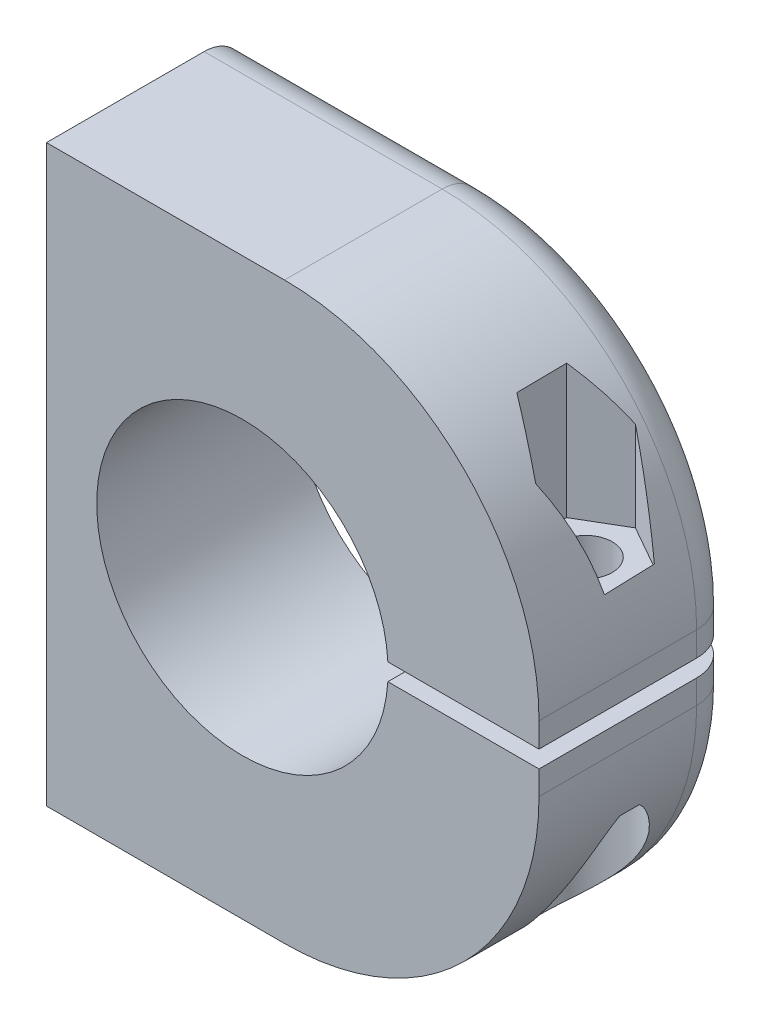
ISO-10303-21;
HEADER;
FILE_DESCRIPTION(('STEP AP214'),'2;1');
FILE_NAME('part.step','',(''),(''),'','','');
FILE_SCHEMA(('AUTOMOTIVE_DESIGN { 1 0 10303 214 1 1 1 1 }'));
ENDSEC;
DATA;
#1=APPLICATION_CONTEXT('core data for automotive mechanical design processes');
#2=APPLICATION_PROTOCOL_DEFINITION('international standard','automotive_design',2000,#1);
#3=PRODUCT_CONTEXT('',#1,'mechanical');
#4=PRODUCT('Part','Part','',(#3));
#5=PRODUCT_RELATED_PRODUCT_CATEGORY('part','',(#4));
#6=PRODUCT_DEFINITION_FORMATION('','',#4);
#7=PRODUCT_DEFINITION_CONTEXT('part definition',#1,'design');
#8=PRODUCT_DEFINITION('design','',#6,#7);
#9=PRODUCT_DEFINITION_SHAPE('','',#8);
#10=(LENGTH_UNIT() NAMED_UNIT(*) SI_UNIT(.MILLI.,.METRE.));
#11=(NAMED_UNIT(*) PLANE_ANGLE_UNIT() SI_UNIT($,.RADIAN.));
#12=(NAMED_UNIT(*) SI_UNIT($,.STERADIAN.) SOLID_ANGLE_UNIT());
#13=UNCERTAINTY_MEASURE_WITH_UNIT(LENGTH_MEASURE(1.E-05),#10,'distance_accuracy_value','');
#14=(GEOMETRIC_REPRESENTATION_CONTEXT(3) GLOBAL_UNCERTAINTY_ASSIGNED_CONTEXT((#13)) GLOBAL_UNIT_ASSIGNED_CONTEXT((#10,
#11,#12)) REPRESENTATION_CONTEXT('',''));
#15=CARTESIAN_POINT('',(0.,0.,0.));
#16=DIRECTION('',(0.,0.,1.));
#17=DIRECTION('',(1.,0.,0.));
#18=AXIS2_PLACEMENT_3D('',#15,#16,#17);
#19=CARTESIAN_POINT('',(59.57321305,5.,12.1));
#20=DIRECTION('',(0.,1.,0.));
#21=DIRECTION('',(0.,0.,1.));
#22=AXIS2_PLACEMENT_3D('',#19,#20,#21);
#23=CYLINDRICAL_SURFACE('',#22,3.25);
#24=CARTESIAN_POINT('',(59.57321305,41.0080516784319,12.1));
#25=DIRECTION('',(0.,1.,0.));
#26=DIRECTION('',(0.,0.,1.));
#27=AXIS2_PLACEMENT_3D('',#24,#25,#26);
#28=CIRCLE('',#27,3.25);
#29=CARTESIAN_POINT('',(59.57321305,41.0080516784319,15.35));
#30=VERTEX_POINT('',#29);
#31=EDGE_CURVE('E375',#30,#30,#28,.T.);
#32=ORIENTED_EDGE('',*,*,#31,.F.);
#33=EDGE_LOOP('',(#32));
#34=FACE_BOUND('',#33,.T.);
#35=CARTESIAN_POINT('',(59.57321305,52.,12.1));
#36=DIRECTION('',(0.,1.,0.));
#37=DIRECTION('',(0.,0.,1.));
#38=AXIS2_PLACEMENT_3D('',#35,#36,#37);
#39=CIRCLE('',#38,3.25);
#40=CARTESIAN_POINT('',(59.57321305,52.,15.35));
#41=VERTEX_POINT('',#40);
#42=EDGE_CURVE('E359',#41,#41,#39,.F.);
#43=ORIENTED_EDGE('',*,*,#42,.F.);
#44=EDGE_LOOP('',(#43));
#45=FACE_BOUND('',#44,.T.);
#46=ADVANCED_FACE('F34',(#34,#45),#23,.F.);
#47=CARTESIAN_POINT('',(59.57321305,38.9158363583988,12.1));
#48=DIRECTION('',(0.,-1.,0.));
#49=DIRECTION('',(0.,0.,-1.));
#50=AXIS2_PLACEMENT_3D('',#47,#48,#49);
#51=CIRCLE('',#50,3.25);
#52=CARTESIAN_POINT('',(59.57321305,38.9158363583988,8.85));
#53=VERTEX_POINT('',#52);
#54=EDGE_CURVE('E379',#53,#53,#51,.T.);
#55=ORIENTED_EDGE('',*,*,#54,.F.);
#56=EDGE_LOOP('',(#55));
#57=FACE_BOUND('',#56,.T.);
#58=CARTESIAN_POINT('',(59.57321305,28.,12.1));
#59=DIRECTION('',(0.,-1.,0.));
#60=DIRECTION('',(0.,0.,-1.));
#61=AXIS2_PLACEMENT_3D('',#58,#59,#60);
#62=CIRCLE('',#61,3.25);
#63=CARTESIAN_POINT('',(59.57321305,28.,8.85));
#64=VERTEX_POINT('',#63);
#65=EDGE_CURVE('E373',#64,#64,#62,.F.);
#66=ORIENTED_EDGE('',*,*,#65,.F.);
#67=EDGE_LOOP('',(#66));
#68=FACE_BOUND('',#67,.T.);
#69=ADVANCED_FACE('F482',(#57,#68),#23,.F.);
#70=CARTESIAN_POINT('',(66.,5.,24.2));
#71=DIRECTION('',(-1.,0.,0.));
#72=DIRECTION('',(0.,0.,1.));
#73=AXIS2_PLACEMENT_3D('',#70,#71,#72);
#74=PLANE('',#73);
#75=DIRECTION('',(0.,0.,-1.));
#76=VECTOR('',#75,1.);
#77=CARTESIAN_POINT('',(66.,41.0080516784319,24.2));
#78=LINE('',#77,#76);
#79=CARTESIAN_POINT('',(66.,41.0080516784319,24.2));
#80=VERTEX_POINT('',#79);
#81=CARTESIAN_POINT('',(66.,41.0080516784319,5.));
#82=VERTEX_POINT('',#81);
#83=EDGE_CURVE('E397',#80,#82,#78,.T.);
#84=ORIENTED_EDGE('',*,*,#83,.T.);
#85=DIRECTION('',(0.,1.,0.));
#86=VECTOR('',#85,1.);
#87=CARTESIAN_POINT('',(66.,44.,5.));
#88=LINE('',#87,#86);
#89=CARTESIAN_POINT('',(66.,44.,5.));
#90=VERTEX_POINT('',#89);
#91=EDGE_CURVE('E554',#82,#90,#88,.T.);
#92=ORIENTED_EDGE('',*,*,#91,.T.);
#93=DIRECTION('',(0.,0.,-1.));
#94=VECTOR('',#93,1.);
#95=CARTESIAN_POINT('',(66.,44.,24.2));
#96=LINE('',#95,#94);
#97=CARTESIAN_POINT('',(66.,44.,24.2));
#98=VERTEX_POINT('',#97);
#99=EDGE_CURVE('E457',#90,#98,#96,.F.);
#100=ORIENTED_EDGE('',*,*,#99,.T.);
#101=DIRECTION('',(0.,1.,0.));
#102=VECTOR('',#101,1.);
#103=CARTESIAN_POINT('',(66.,5.,24.2));
#104=LINE('',#103,#102);
#105=EDGE_CURVE('E414',#80,#98,#104,.T.);
#106=ORIENTED_EDGE('',*,*,#105,.F.);
#107=EDGE_LOOP('',(#84,#92,#100,#106));
#108=FACE_BOUND('',#107,.T.);
#109=ADVANCED_FACE('F513',(#108),#74,.F.);
#110=CARTESIAN_POINT('',(6.00000000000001,5.,24.2));
#111=DIRECTION('',(1.,0.,0.));
#112=DIRECTION('',(0.,0.,-1.));
#113=AXIS2_PLACEMENT_3D('',#110,#111,#112);
#114=PLANE('',#113);
#115=CARTESIAN_POINT('',(6.00000000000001,67.,12.2));
#116=DIRECTION('',(-1.,0.,0.));
#117=DIRECTION('',(0.,0.,1.));
#118=AXIS2_PLACEMENT_3D('',#115,#116,#117);
#119=CIRCLE('',#118,3.25);
#120=CARTESIAN_POINT('',(6.00000000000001,67.,15.45));
#121=VERTEX_POINT('',#120);
#122=EDGE_CURVE('E324',#121,#121,#119,.T.);
#123=ORIENTED_EDGE('',*,*,#122,.F.);
#124=EDGE_LOOP('',(#123));
#125=FACE_BOUND('',#124,.T.);
#126=CARTESIAN_POINT('',(6.00000000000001,13.,12.2));
#127=DIRECTION('',(-1.,0.,0.));
#128=DIRECTION('',(0.,0.,1.));
#129=AXIS2_PLACEMENT_3D('',#126,#127,#128);
#130=CIRCLE('',#129,3.25);
#131=CARTESIAN_POINT('',(6.00000000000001,13.,15.45));
#132=VERTEX_POINT('',#131);
#133=EDGE_CURVE('E328',#132,#132,#130,.T.);
#134=ORIENTED_EDGE('',*,*,#133,.F.);
#135=EDGE_LOOP('',(#134));
#136=FACE_BOUND('',#135,.T.);
#137=DIRECTION('',(0.,-1.,0.));
#138=VECTOR('',#137,1.);
#139=CARTESIAN_POINT('',(6.00000000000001,5.,0.));
#140=LINE('',#139,#138);
#141=CARTESIAN_POINT('',(6.00000000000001,70.,0.));
#142=VERTEX_POINT('',#141);
#143=CARTESIAN_POINT('',(6.00000000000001,10.,0.));
#144=VERTEX_POINT('',#143);
#145=EDGE_CURVE('E400',#142,#144,#140,.T.);
#146=ORIENTED_EDGE('',*,*,#145,.T.);
#147=CARTESIAN_POINT('',(6.00000000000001,10.,5.));
#148=DIRECTION('',(1.,0.,0.));
#149=DIRECTION('',(0.,0.,-1.));
#150=AXIS2_PLACEMENT_3D('',#147,#148,#149);
#151=CIRCLE('',#150,5.);
#152=CARTESIAN_POINT('',(6.00000000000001,5.,5.));
#153=VERTEX_POINT('',#152);
#154=EDGE_CURVE('E530',#144,#153,#151,.F.);
#155=ORIENTED_EDGE('',*,*,#154,.T.);
#156=DIRECTION('',(0.,0.,-1.));
#157=VECTOR('',#156,1.);
#158=CARTESIAN_POINT('',(6.00000000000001,5.,24.2));
#159=LINE('',#158,#157);
#160=CARTESIAN_POINT('',(6.00000000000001,5.,24.2));
#161=VERTEX_POINT('',#160);
#162=EDGE_CURVE('E424',#161,#153,#159,.T.);
#163=ORIENTED_EDGE('',*,*,#162,.F.);
#164=DIRECTION('',(0.,-1.,0.));
#165=VECTOR('',#164,1.);
#166=CARTESIAN_POINT('',(6.00000000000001,5.,24.2));
#167=LINE('',#166,#165);
#168=CARTESIAN_POINT('',(6.00000000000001,75.,24.2));
#169=VERTEX_POINT('',#168);
#170=EDGE_CURVE('E408',#169,#161,#167,.T.);
#171=ORIENTED_EDGE('',*,*,#170,.F.);
#172=DIRECTION('',(0.,0.,-1.));
#173=VECTOR('',#172,1.);
#174=CARTESIAN_POINT('',(6.00000000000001,75.,24.2));
#175=LINE('',#174,#173);
#176=CARTESIAN_POINT('',(6.00000000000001,75.,5.));
#177=VERTEX_POINT('',#176);
#178=EDGE_CURVE('E419',#169,#177,#175,.T.);
#179=ORIENTED_EDGE('',*,*,#178,.T.);
#180=CARTESIAN_POINT('',(6.00000000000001,70.,5.));
#181=DIRECTION('',(1.,0.,0.));
#182=DIRECTION('',(0.,0.,-1.));
#183=AXIS2_PLACEMENT_3D('',#180,#181,#182);
#184=CIRCLE('',#183,5.);
#185=EDGE_CURVE('E532',#177,#142,#184,.F.);
#186=ORIENTED_EDGE('',*,*,#185,.T.);
#187=EDGE_LOOP('',(#146,#155,#163,#171,#179,#186));
#188=FACE_BOUND('',#187,.T.);
#189=ADVANCED_FACE('F515',(#125,#136,#188),#114,.F.);
#190=CARTESIAN_POINT('',(6.00000000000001,5.,24.2));
#191=DIRECTION('',(0.,1.,0.));
#192=DIRECTION('',(0.,0.,1.));
#193=AXIS2_PLACEMENT_3D('',#190,#191,#192);
#194=PLANE('',#193);
#195=ORIENTED_EDGE('',*,*,#162,.T.);
#196=DIRECTION('',(1.,0.,0.));
#197=VECTOR('',#196,1.);
#198=CARTESIAN_POINT('',(35.,5.,5.));
#199=LINE('',#198,#197);
#200=CARTESIAN_POINT('',(35.,5.,5.));
#201=VERTEX_POINT('',#200);
#202=EDGE_CURVE('E542',#153,#201,#199,.T.);
#203=ORIENTED_EDGE('',*,*,#202,.T.);
#204=DIRECTION('',(0.,0.,-1.));
#205=VECTOR('',#204,1.);
#206=CARTESIAN_POINT('',(35.,5.,24.2));
#207=LINE('',#206,#205);
#208=CARTESIAN_POINT('',(35.,5.,24.2));
#209=VERTEX_POINT('',#208);
#210=EDGE_CURVE('E448',#201,#209,#207,.F.);
#211=ORIENTED_EDGE('',*,*,#210,.T.);
#212=DIRECTION('',(1.,0.,0.));
#213=VECTOR('',#212,1.);
#214=CARTESIAN_POINT('',(6.00000000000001,5.,24.2));
#215=LINE('',#214,#213);
#216=EDGE_CURVE('E411',#161,#209,#215,.T.);
#217=ORIENTED_EDGE('',*,*,#216,.F.);
#218=EDGE_LOOP('',(#195,#203,#211,#217));
#219=FACE_BOUND('',#218,.T.);
#220=ADVANCED_FACE('F511',(#219),#194,.F.);
#221=DIRECTION('',(0.,0.,-1.));
#222=VECTOR('',#221,1.);
#223=CARTESIAN_POINT('',(66.,36.,24.2));
#224=LINE('',#223,#222);
#225=CARTESIAN_POINT('',(66.,36.,24.2));
#226=VERTEX_POINT('',#225);
#227=CARTESIAN_POINT('',(66.,36.,5.));
#228=VERTEX_POINT('',#227);
#229=EDGE_CURVE('E445',#226,#228,#224,.T.);
#230=ORIENTED_EDGE('',*,*,#229,.T.);
#231=DIRECTION('',(0.,1.,0.));
#232=VECTOR('',#231,1.);
#233=CARTESIAN_POINT('',(66.,38.9158363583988,5.));
#234=LINE('',#233,#232);
#235=CARTESIAN_POINT('',(66.,38.9158363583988,5.));
#236=VERTEX_POINT('',#235);
#237=EDGE_CURVE('E545',#228,#236,#234,.T.);
#238=ORIENTED_EDGE('',*,*,#237,.T.);
#239=DIRECTION('',(0.,0.,-1.));
#240=VECTOR('',#239,1.);
#241=CARTESIAN_POINT('',(66.,38.9158363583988,24.2));
#242=LINE('',#241,#240);
#243=CARTESIAN_POINT('',(66.,38.9158363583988,24.2));
#244=VERTEX_POINT('',#243);
#245=EDGE_CURVE('E390',#244,#236,#242,.T.);
#246=ORIENTED_EDGE('',*,*,#245,.F.);
#247=EDGE_CURVE('E415',#226,#244,#104,.T.);
#248=ORIENTED_EDGE('',*,*,#247,.F.);
#249=EDGE_LOOP('',(#230,#238,#246,#248));
#250=FACE_BOUND('',#249,.T.);
#251=ADVANCED_FACE('F507',(#250),#74,.F.);
#252=CARTESIAN_POINT('',(6.00000000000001,75.,24.2));
#253=DIRECTION('',(0.,-1.,0.));
#254=DIRECTION('',(0.,0.,-1.));
#255=AXIS2_PLACEMENT_3D('',#252,#253,#254);
#256=PLANE('',#255);
#257=DIRECTION('',(0.,0.,-1.));
#258=VECTOR('',#257,1.);
#259=CARTESIAN_POINT('',(35.,75.,24.2));
#260=LINE('',#259,#258);
#261=CARTESIAN_POINT('',(35.,75.,24.2));
#262=VERTEX_POINT('',#261);
#263=CARTESIAN_POINT('',(35.,75.,5.));
#264=VERTEX_POINT('',#263);
#265=EDGE_CURVE('E454',#262,#264,#260,.T.);
#266=ORIENTED_EDGE('',*,*,#265,.T.);
#267=DIRECTION('',(-1.,0.,0.));
#268=VECTOR('',#267,1.);
#269=CARTESIAN_POINT('',(6.00000000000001,75.,5.));
#270=LINE('',#269,#268);
#271=EDGE_CURVE('E561',#264,#177,#270,.T.);
#272=ORIENTED_EDGE('',*,*,#271,.T.);
#273=ORIENTED_EDGE('',*,*,#178,.F.);
#274=DIRECTION('',(-1.,0.,0.));
#275=VECTOR('',#274,1.);
#276=CARTESIAN_POINT('',(6.00000000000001,75.,24.2));
#277=LINE('',#276,#275);
#278=EDGE_CURVE('E417',#262,#169,#277,.T.);
#279=ORIENTED_EDGE('',*,*,#278,.F.);
#280=EDGE_LOOP('',(#266,#272,#273,#279));
#281=FACE_BOUND('',#280,.T.);
#282=ADVANCED_FACE('F500',(#281),#256,.F.);
#283=CARTESIAN_POINT('',(6.00000000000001,75.,24.2));
#284=DIRECTION('',(0.,0.,-1.));
#285=DIRECTION('',(-1.,0.,0.));
#286=AXIS2_PLACEMENT_3D('',#283,#284,#285);
#287=PLANE('',#286);
#288=ORIENTED_EDGE('',*,*,#216,.T.);
#289=CARTESIAN_POINT('',(35.,36.,24.2));
#290=DIRECTION('',(0.,0.,-1.));
#291=DIRECTION('',(-1.,0.,0.));
#292=AXIS2_PLACEMENT_3D('',#289,#290,#291);
#293=CIRCLE('',#292,31.);
#294=EDGE_CURVE('E452',#209,#226,#293,.F.);
#295=ORIENTED_EDGE('',*,*,#294,.T.);
#296=ORIENTED_EDGE('',*,*,#247,.T.);
#297=DIRECTION('',(-1.,0.,0.));
#298=VECTOR('',#297,1.);
#299=CARTESIAN_POINT('',(66.,38.9158363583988,24.2));
#300=LINE('',#299,#298);
#301=CARTESIAN_POINT('',(47.584543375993,38.9158363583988,24.2));
#302=VERTEX_POINT('',#301);
#303=EDGE_CURVE('E380',#244,#302,#300,.T.);
#304=ORIENTED_EDGE('',*,*,#303,.T.);
#305=CARTESIAN_POINT('',(29.8676844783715,40.,24.2));
#306=DIRECTION('',(0.,0.,-1.));
#307=DIRECTION('',(-1.,0.,0.));
#308=AXIS2_PLACEMENT_3D('',#305,#306,#307);
#309=CIRCLE('',#308,17.75);
#310=CARTESIAN_POINT('',(47.5890369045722,41.0080516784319,24.2));
#311=VERTEX_POINT('',#310);
#312=EDGE_CURVE('E383',#302,#311,#309,.T.);
#313=ORIENTED_EDGE('',*,*,#312,.T.);
#314=DIRECTION('',(1.,0.,0.));
#315=VECTOR('',#314,1.);
#316=CARTESIAN_POINT('',(66.,41.0080516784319,24.2));
#317=LINE('',#316,#315);
#318=EDGE_CURVE('E387',#311,#80,#317,.T.);
#319=ORIENTED_EDGE('',*,*,#318,.T.);
#320=ORIENTED_EDGE('',*,*,#105,.T.);
#321=CARTESIAN_POINT('',(35.,44.,24.2));
#322=DIRECTION('',(0.,0.,-1.));
#323=DIRECTION('',(-1.,0.,0.));
#324=AXIS2_PLACEMENT_3D('',#321,#322,#323);
#325=CIRCLE('',#324,31.);
#326=EDGE_CURVE('E450',#98,#262,#325,.F.);
#327=ORIENTED_EDGE('',*,*,#326,.T.);
#328=ORIENTED_EDGE('',*,*,#278,.T.);
#329=ORIENTED_EDGE('',*,*,#170,.T.);
#330=EDGE_LOOP('',(#288,#295,#296,#304,#313,#319,#320,#327,#328,#329));
#331=FACE_BOUND('',#330,.T.);
#332=ADVANCED_FACE('F497',(#331),#287,.F.);
#333=CARTESIAN_POINT('',(6.00000000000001,75.,0.));
#334=DIRECTION('',(0.,0.,-1.));
#335=DIRECTION('',(-1.,0.,0.));
#336=AXIS2_PLACEMENT_3D('',#333,#334,#335);
#337=PLANE('',#336);
#338=DIRECTION('',(0.,1.,0.));
#339=VECTOR('',#338,1.);
#340=CARTESIAN_POINT('',(15.7,75.,0.));
#341=LINE('',#340,#339);
#342=CARTESIAN_POINT('',(15.7,10.,0.));
#343=VERTEX_POINT('',#342);
#344=CARTESIAN_POINT('',(15.7,18.2874813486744,0.));
#345=VERTEX_POINT('',#344);
#346=EDGE_CURVE('E322',#343,#345,#341,.T.);
#347=ORIENTED_EDGE('',*,*,#346,.F.);
#348=DIRECTION('',(1.,0.,0.));
#349=VECTOR('',#348,1.);
#350=CARTESIAN_POINT('',(6.00000000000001,10.,0.));
#351=LINE('',#350,#349);
#352=EDGE_CURVE('E540',#343,#144,#351,.F.);
#353=ORIENTED_EDGE('',*,*,#352,.T.);
#354=ORIENTED_EDGE('',*,*,#145,.F.);
#355=DIRECTION('',(-1.,0.,0.));
#356=VECTOR('',#355,1.);
#357=CARTESIAN_POINT('',(35.,70.,0.));
#358=LINE('',#357,#356);
#359=CARTESIAN_POINT('',(15.7,70.,0.));
#360=VERTEX_POINT('',#359);
#361=EDGE_CURVE('E606',#142,#360,#358,.F.);
#362=ORIENTED_EDGE('',*,*,#361,.T.);
#363=DIRECTION('',(0.,1.,0.));
#364=VECTOR('',#363,1.);
#365=CARTESIAN_POINT('',(15.7,75.,0.));
#366=LINE('',#365,#364);
#367=CARTESIAN_POINT('',(15.7,61.75,0.));
#368=VERTEX_POINT('',#367);
#369=EDGE_CURVE('E287',#368,#360,#366,.T.);
#370=ORIENTED_EDGE('',*,*,#369,.F.);
#371=DIRECTION('',(1.,0.,0.));
#372=VECTOR('',#371,1.);
#373=CARTESIAN_POINT('',(6.00000000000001,61.75,0.));
#374=LINE('',#373,#372);
#375=CARTESIAN_POINT('',(21.,61.75,0.));
#376=VERTEX_POINT('',#375);
#377=EDGE_CURVE('E439',#368,#376,#374,.T.);
#378=ORIENTED_EDGE('',*,*,#377,.T.);
#379=DIRECTION('',(0.,1.,0.));
#380=VECTOR('',#379,1.);
#381=CARTESIAN_POINT('',(21.,75.,0.));
#382=LINE('',#381,#380);
#383=CARTESIAN_POINT('',(21.,70.,0.));
#384=VERTEX_POINT('',#383);
#385=EDGE_CURVE('E279',#376,#384,#382,.T.);
#386=ORIENTED_EDGE('',*,*,#385,.T.);
#387=DIRECTION('',(-1.,0.,0.));
#388=VECTOR('',#387,1.);
#389=CARTESIAN_POINT('',(35.,70.,0.));
#390=LINE('',#389,#388);
#391=CARTESIAN_POINT('',(35.,70.,0.));
#392=VERTEX_POINT('',#391);
#393=EDGE_CURVE('E586',#384,#392,#390,.F.);
#394=ORIENTED_EDGE('',*,*,#393,.T.);
#395=CARTESIAN_POINT('',(35.,44.,0.));
#396=DIRECTION('',(0.,0.,-1.));
#397=DIRECTION('',(-1.,0.,0.));
#398=AXIS2_PLACEMENT_3D('',#395,#396,#397);
#399=CIRCLE('',#398,26.);
#400=CARTESIAN_POINT('',(61.,44.,0.));
#401=VERTEX_POINT('',#400);
#402=EDGE_CURVE('E581',#392,#401,#399,.T.);
#403=ORIENTED_EDGE('',*,*,#402,.T.);
#404=DIRECTION('',(0.,1.,0.));
#405=VECTOR('',#404,1.);
#406=CARTESIAN_POINT('',(61.,41.0080516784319,0.));
#407=LINE('',#406,#405);
#408=CARTESIAN_POINT('',(61.,41.0080516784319,0.));
#409=VERTEX_POINT('',#408);
#410=EDGE_CURVE('E604',#401,#409,#407,.F.);
#411=ORIENTED_EDGE('',*,*,#410,.T.);
#412=DIRECTION('',(1.,0.,0.));
#413=VECTOR('',#412,1.);
#414=CARTESIAN_POINT('',(66.,41.0080516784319,0.));
#415=LINE('',#414,#413);
#416=CARTESIAN_POINT('',(47.5890369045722,41.0080516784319,0.));
#417=VERTEX_POINT('',#416);
#418=EDGE_CURVE('E384',#417,#409,#415,.T.);
#419=ORIENTED_EDGE('',*,*,#418,.F.);
#420=CARTESIAN_POINT('',(29.8676844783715,40.,0.));
#421=DIRECTION('',(0.,0.,-1.));
#422=DIRECTION('',(-1.,0.,0.));
#423=AXIS2_PLACEMENT_3D('',#420,#421,#422);
#424=CIRCLE('',#423,17.75);
#425=CARTESIAN_POINT('',(47.584543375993,38.9158363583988,0.));
#426=VERTEX_POINT('',#425);
#427=EDGE_CURVE('E392',#426,#417,#424,.T.);
#428=ORIENTED_EDGE('',*,*,#427,.F.);
#429=DIRECTION('',(-1.,0.,0.));
#430=VECTOR('',#429,1.);
#431=CARTESIAN_POINT('',(66.,38.9158363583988,0.));
#432=LINE('',#431,#430);
#433=CARTESIAN_POINT('',(61.,38.9158363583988,0.));
#434=VERTEX_POINT('',#433);
#435=EDGE_CURVE('E378',#434,#426,#432,.T.);
#436=ORIENTED_EDGE('',*,*,#435,.F.);
#437=DIRECTION('',(0.,1.,0.));
#438=VECTOR('',#437,1.);
#439=CARTESIAN_POINT('',(61.,36.,0.));
#440=LINE('',#439,#438);
#441=CARTESIAN_POINT('',(61.,36.,0.));
#442=VERTEX_POINT('',#441);
#443=EDGE_CURVE('E608',#434,#442,#440,.F.);
#444=ORIENTED_EDGE('',*,*,#443,.T.);
#445=CARTESIAN_POINT('',(35.,36.,0.));
#446=DIRECTION('',(0.,0.,-1.));
#447=DIRECTION('',(-1.,0.,0.));
#448=AXIS2_PLACEMENT_3D('',#445,#446,#447);
#449=CIRCLE('',#448,26.);
#450=CARTESIAN_POINT('',(35.,10.,0.));
#451=VERTEX_POINT('',#450);
#452=EDGE_CURVE('E614',#442,#451,#449,.T.);
#453=ORIENTED_EDGE('',*,*,#452,.T.);
#454=DIRECTION('',(1.,0.,0.));
#455=VECTOR('',#454,1.);
#456=CARTESIAN_POINT('',(6.00000000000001,10.,0.));
#457=LINE('',#456,#455);
#458=CARTESIAN_POINT('',(21.,10.,0.));
#459=VERTEX_POINT('',#458);
#460=EDGE_CURVE('E616',#451,#459,#457,.F.);
#461=ORIENTED_EDGE('',*,*,#460,.T.);
#462=DIRECTION('',(0.,1.,0.));
#463=VECTOR('',#462,1.);
#464=CARTESIAN_POINT('',(21.,75.,0.));
#465=LINE('',#464,#463);
#466=CARTESIAN_POINT('',(21.,18.2874813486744,0.));
#467=VERTEX_POINT('',#466);
#468=EDGE_CURVE('E319',#459,#467,#465,.T.);
#469=ORIENTED_EDGE('',*,*,#468,.T.);
#470=DIRECTION('',(-1.,0.,0.));
#471=VECTOR('',#470,1.);
#472=CARTESIAN_POINT('',(6.00000000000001,18.2874813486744,0.));
#473=LINE('',#472,#471);
#474=EDGE_CURVE('E427',#467,#345,#473,.T.);
#475=ORIENTED_EDGE('',*,*,#474,.T.);
#476=EDGE_LOOP('',(#347,#353,#354,#362,#370,#378,#386,#394,#403,#411,#419,#428,#436,#444,#453,
#461,#469,#475));
#477=FACE_BOUND('',#476,.T.);
#478=ADVANCED_FACE('F488',(#477),#337,.T.);
#479=CARTESIAN_POINT('',(66.,41.0080516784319,24.2));
#480=DIRECTION('',(0.,1.,0.));
#481=DIRECTION('',(0.,0.,1.));
#482=AXIS2_PLACEMENT_3D('',#479,#480,#481);
#483=PLANE('',#482);
#484=ORIENTED_EDGE('',*,*,#31,.T.);
#485=EDGE_LOOP('',(#484));
#486=FACE_BOUND('',#485,.T.);
#487=ORIENTED_EDGE('',*,*,#418,.T.);
#488=CARTESIAN_POINT('',(61.,41.0080516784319,5.));
#489=DIRECTION('',(0.,1.,0.));
#490=DIRECTION('',(0.,0.,1.));
#491=AXIS2_PLACEMENT_3D('',#488,#489,#490);
#492=CIRCLE('',#491,5.);
#493=EDGE_CURVE('E557',#409,#82,#492,.F.);
#494=ORIENTED_EDGE('',*,*,#493,.T.);
#495=ORIENTED_EDGE('',*,*,#83,.F.);
#496=ORIENTED_EDGE('',*,*,#318,.F.);
#497=DIRECTION('',(0.,0.,-1.));
#498=VECTOR('',#497,1.);
#499=CARTESIAN_POINT('',(47.5890369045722,41.0080516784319,24.2));
#500=LINE('',#499,#498);
#501=EDGE_CURVE('E401',#311,#417,#500,.T.);
#502=ORIENTED_EDGE('',*,*,#501,.T.);
#503=EDGE_LOOP('',(#487,#494,#495,#496,#502));
#504=FACE_BOUND('',#503,.T.);
#505=ADVANCED_FACE('F484',(#486,#504),#483,.F.);
#506=CARTESIAN_POINT('',(29.8676844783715,40.,24.2));
#507=DIRECTION('',(0.,0.,-1.));
#508=DIRECTION('',(-1.,0.,0.));
#509=AXIS2_PLACEMENT_3D('',#506,#507,#508);
#510=CYLINDRICAL_SURFACE('',#509,17.75);
#511=ORIENTED_EDGE('',*,*,#427,.T.);
#512=ORIENTED_EDGE('',*,*,#501,.F.);
#513=ORIENTED_EDGE('',*,*,#312,.F.);
#514=DIRECTION('',(0.,0.,-1.));
#515=VECTOR('',#514,1.);
#516=CARTESIAN_POINT('',(47.584543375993,38.9158363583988,24.2));
#517=LINE('',#516,#515);
#518=EDGE_CURVE('E403',#302,#426,#517,.T.);
#519=ORIENTED_EDGE('',*,*,#518,.T.);
#520=EDGE_LOOP('',(#511,#512,#513,#519));
#521=FACE_BOUND('',#520,.T.);
#522=ADVANCED_FACE('F487',(#521),#510,.F.);
#523=CARTESIAN_POINT('',(66.,38.9158363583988,24.2));
#524=DIRECTION('',(0.,-1.,0.));
#525=DIRECTION('',(0.,0.,-1.));
#526=AXIS2_PLACEMENT_3D('',#523,#524,#525);
#527=PLANE('',#526);
#528=ORIENTED_EDGE('',*,*,#54,.T.);
#529=EDGE_LOOP('',(#528));
#530=FACE_BOUND('',#529,.T.);
#531=ORIENTED_EDGE('',*,*,#245,.T.);
#532=CARTESIAN_POINT('',(61.,38.9158363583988,5.));
#533=DIRECTION('',(0.,-1.,0.));
#534=DIRECTION('',(0.,0.,-1.));
#535=AXIS2_PLACEMENT_3D('',#532,#533,#534);
#536=CIRCLE('',#535,5.);
#537=EDGE_CURVE('E552',#236,#434,#536,.F.);
#538=ORIENTED_EDGE('',*,*,#537,.T.);
#539=ORIENTED_EDGE('',*,*,#435,.T.);
#540=ORIENTED_EDGE('',*,*,#518,.F.);
#541=ORIENTED_EDGE('',*,*,#303,.F.);
#542=EDGE_LOOP('',(#531,#538,#539,#540,#541));
#543=FACE_BOUND('',#542,.T.);
#544=ADVANCED_FACE('F492',(#530,#543),#527,.F.);
#545=CARTESIAN_POINT('',(59.57321305,28.,12.1));
#546=DIRECTION('',(0.,-1.,0.));
#547=DIRECTION('',(0.,0.,-1.));
#548=AXIS2_PLACEMENT_3D('',#545,#546,#547);
#549=PLANE('',#548);
#550=CARTESIAN_POINT('',(59.57321305,28.,12.1));
#551=DIRECTION('',(0.,-1.,0.));
#552=DIRECTION('',(0.,0.,-1.));
#553=AXIS2_PLACEMENT_3D('',#550,#551,#552);
#554=CIRCLE('',#553,5.5);
#555=CARTESIAN_POINT('',(64.9499582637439,28.,13.2578475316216));
#556=VERTEX_POINT('',#555);
#557=CARTESIAN_POINT('',(64.9499582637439,28.,10.9421524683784));
#558=VERTEX_POINT('',#557);
#559=EDGE_CURVE('E370',#556,#558,#554,.T.);
#560=ORIENTED_EDGE('',*,*,#559,.T.);
#561=DIRECTION('',(0.,0.,-1.));
#562=VECTOR('',#561,1.);
#563=CARTESIAN_POINT('',(64.9499582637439,28.,24.2));
#564=LINE('',#563,#562);
#565=EDGE_CURVE('E459',#556,#558,#564,.T.);
#566=ORIENTED_EDGE('',*,*,#565,.F.);
#567=EDGE_LOOP('',(#560,#566));
#568=FACE_BOUND('',#567,.T.);
#569=ORIENTED_EDGE('',*,*,#65,.T.);
#570=EDGE_LOOP('',(#569));
#571=FACE_BOUND('',#570,.T.);
#572=ADVANCED_FACE('F477',(#568,#571),#549,.T.);
#573=CARTESIAN_POINT('',(59.57321305,28.,12.1));
#574=DIRECTION('',(0.,-1.,0.));
#575=DIRECTION('',(0.,0.,-1.));
#576=AXIS2_PLACEMENT_3D('',#573,#574,#575);
#577=CYLINDRICAL_SURFACE('',#576,5.5);
#578=ORIENTED_EDGE('',*,*,#559,.F.);
#579=CARTESIAN_POINT('',(55.34342095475,12.608864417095,15.6155168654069));
#580=CARTESIAN_POINT('',(55.2652517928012,12.5408800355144,15.5214655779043));
#581=CARTESIAN_POINT('',(55.1892916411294,12.4755065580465,15.4236881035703));
#582=CARTESIAN_POINT('',(55.0426410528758,12.3504371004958,15.220829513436));
#583=CARTESIAN_POINT('',(54.9719498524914,12.2907402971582,15.1157494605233));
#584=CARTESIAN_POINT('',(54.8366353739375,12.1774120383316,14.8984338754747));
#585=CARTESIAN_POINT('',(54.7720188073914,12.1237872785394,14.7861906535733));
#586=CARTESIAN_POINT('',(54.6498662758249,12.0231566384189,14.5551420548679));
#587=CARTESIAN_POINT('',(54.5923269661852,11.9761476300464,14.4363398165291));
#588=CARTESIAN_POINT('',(54.4848189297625,11.8888685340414,14.1919326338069));
#589=CARTESIAN_POINT('',(54.4349020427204,11.8486444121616,14.0662883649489));
#590=CARTESIAN_POINT('',(54.34394737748,11.7757332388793,13.8097630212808));
#591=CARTESIAN_POINT('',(54.3029057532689,11.7430429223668,13.6788842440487));
#592=CARTESIAN_POINT('',(54.2304204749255,11.685537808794,13.4128472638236));
#593=CARTESIAN_POINT('',(54.1989737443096,11.6607204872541,13.2776904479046));
#594=CARTESIAN_POINT('',(54.1462574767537,11.6192298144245,13.0041811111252));
#595=CARTESIAN_POINT('',(54.1249869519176,11.6025556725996,12.865828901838));
#596=CARTESIAN_POINT('',(54.0944376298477,11.5786406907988,12.5993936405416));
#597=CARTESIAN_POINT('',(54.0842707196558,11.5707007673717,12.4714741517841));
#598=CARTESIAN_POINT('',(54.0729176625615,11.5618358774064,12.2149972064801));
#599=CARTESIAN_POINT('',(54.0717310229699,11.560910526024,12.0864397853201));
#600=CARTESIAN_POINT('',(54.0783575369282,11.5660831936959,11.829728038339));
#601=CARTESIAN_POINT('',(54.0861687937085,11.5721797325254,11.7015736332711));
#602=CARTESIAN_POINT('',(54.1106568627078,11.5913327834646,11.4466421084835));
#603=CARTESIAN_POINT('',(54.1273335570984,11.604389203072,11.3198649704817));
#604=CARTESIAN_POINT('',(54.1682694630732,11.6365419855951,11.0746778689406));
#605=CARTESIAN_POINT('',(54.1921264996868,11.6553185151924,10.9561582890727));
#606=CARTESIAN_POINT('',(54.2472872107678,11.6989059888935,10.721960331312));
#607=CARTESIAN_POINT('',(54.2785932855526,11.7237188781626,10.6062828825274));
#608=CARTESIAN_POINT('',(54.3482042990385,11.7791625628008,10.3785319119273));
#609=CARTESIAN_POINT('',(54.3865066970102,11.8097912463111,10.2664570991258));
#610=CARTESIAN_POINT('',(54.4696113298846,11.876627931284,10.0464411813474));
#611=CARTESIAN_POINT('',(54.514415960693,11.9128379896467,9.93850161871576));
#612=CARTESIAN_POINT('',(54.6628217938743,12.0335600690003,9.61052417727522));
#613=CARTESIAN_POINT('',(54.7767048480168,12.1272475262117,9.39835414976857));
#614=CARTESIAN_POINT('',(55.0253507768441,12.3354369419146,8.99796248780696));
#615=CARTESIAN_POINT('',(55.1601245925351,12.449949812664,8.80975349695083));
#616=CARTESIAN_POINT('',(55.4026173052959,12.660103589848,8.51093876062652));
#617=CARTESIAN_POINT('',(55.5064544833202,12.7512217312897,8.39390516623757));
#618=CARTESIAN_POINT('',(55.7200412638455,12.941370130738,8.17230788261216));
#619=CARTESIAN_POINT('',(55.8297926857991,13.0404028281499,8.06774806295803));
#620=CARTESIAN_POINT('',(56.1658764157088,13.3483452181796,7.77229262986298));
#621=CARTESIAN_POINT('',(56.3988710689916,13.567956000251,7.59982034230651));
#622=CARTESIAN_POINT('',(56.7977498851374,13.9566331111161,7.34775410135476));
#623=CARTESIAN_POINT('',(56.9618282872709,14.1200212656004,7.25598331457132));
#624=CARTESIAN_POINT('',(57.2911162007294,14.4555972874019,7.09242606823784));
#625=CARTESIAN_POINT('',(57.4563261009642,14.627788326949,7.02064687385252));
#626=CARTESIAN_POINT('',(57.7859927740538,14.9796111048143,6.89548484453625));
#627=CARTESIAN_POINT('',(57.9504488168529,15.1592488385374,6.8421171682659));
#628=CARTESIAN_POINT('',(58.2770487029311,15.5246710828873,6.75223075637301));
#629=CARTESIAN_POINT('',(58.4391925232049,15.710455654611,6.71571218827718));
#630=CARTESIAN_POINT('',(58.8389613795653,16.1798094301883,6.64380814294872));
#631=CARTESIAN_POINT('',(59.0745357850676,16.4665794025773,6.61779271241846));
#632=CARTESIAN_POINT('',(59.5357546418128,17.0491424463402,6.59528057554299));
#633=CARTESIAN_POINT('',(59.761394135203,17.344939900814,6.59879844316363));
#634=CARTESIAN_POINT('',(60.2018246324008,17.9443427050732,6.63156846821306));
#635=CARTESIAN_POINT('',(60.4165825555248,18.2479680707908,6.66089463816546));
#636=CARTESIAN_POINT('',(60.8336580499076,18.8605883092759,6.74216299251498));
#637=CARTESIAN_POINT('',(61.0359767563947,19.1695826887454,6.79410310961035));
#638=CARTESIAN_POINT('',(61.3747254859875,19.7074926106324,6.9012503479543));
#639=CARTESIAN_POINT('',(61.5141768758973,19.9354646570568,6.9517748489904));
#640=CARTESIAN_POINT('',(61.7861339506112,20.3931465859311,7.06268433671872));
#641=CARTESIAN_POINT('',(61.9186396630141,20.6228564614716,7.12306928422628));
#642=CARTESIAN_POINT('',(62.1767462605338,21.0837577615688,7.25309253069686));
#643=CARTESIAN_POINT('',(62.302341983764,21.3149501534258,7.32273761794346));
#644=CARTESIAN_POINT('',(62.5464964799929,21.7782181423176,7.47074904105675));
#645=CARTESIAN_POINT('',(62.6650560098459,22.0102936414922,7.54911443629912));
#646=CARTESIAN_POINT('',(62.8948267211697,22.4742664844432,7.71401954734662));
#647=CARTESIAN_POINT('',(63.0060578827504,22.706162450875,7.80053532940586));
#648=CARTESIAN_POINT('',(63.2215384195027,23.1699516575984,7.98180296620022));
#649=CARTESIAN_POINT('',(63.3257884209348,23.4018448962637,8.07655408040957));
#650=CARTESIAN_POINT('',(63.5272420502,23.8649198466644,8.27435367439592));
#651=CARTESIAN_POINT('',(63.6244507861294,24.0961019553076,8.37739602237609));
#652=CARTESIAN_POINT('',(63.8118681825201,24.5571795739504,8.59227367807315));
#653=CARTESIAN_POINT('',(63.9020781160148,24.7870753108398,8.70410737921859));
#654=CARTESIAN_POINT('',(64.0366040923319,25.1421051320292,8.88525763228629));
#655=CARTESIAN_POINT('',(64.0833801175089,25.2680459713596,8.95118467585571));
#656=CARTESIAN_POINT('',(64.1747484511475,25.5189755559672,9.08627703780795));
#657=CARTESIAN_POINT('',(64.2193408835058,25.6439643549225,9.15544217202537));
#658=CARTESIAN_POINT('',(64.3063964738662,25.8929452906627,9.29751333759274));
#659=CARTESIAN_POINT('',(64.3488548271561,26.0169346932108,9.37042712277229));
#660=CARTESIAN_POINT('',(64.4314705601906,26.2631934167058,9.52033710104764));
#661=CARTESIAN_POINT('',(64.4716281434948,26.3854628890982,9.59733293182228));
#662=CARTESIAN_POINT('',(64.5502774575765,26.62994691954,9.75757598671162));
#663=CARTESIAN_POINT('',(64.5887236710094,26.7521172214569,9.84091352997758));
#664=CARTESIAN_POINT('',(64.6629462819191,26.9930311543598,10.0135086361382));
#665=CARTESIAN_POINT('',(64.6987232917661,27.1117755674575,10.1027648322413));
#666=CARTESIAN_POINT('',(64.7671913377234,27.3438521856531,10.2882777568));
#667=CARTESIAN_POINT('',(64.7998937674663,27.4572035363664,10.3845060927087));
#668=CARTESIAN_POINT('',(64.8618329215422,27.6763099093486,10.5861823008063));
#669=CARTESIAN_POINT('',(64.8910745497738,27.7820755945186,10.6916167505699));
#670=CARTESIAN_POINT('',(64.936662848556,27.9500768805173,10.879521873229));
#671=CARTESIAN_POINT('',(64.9541730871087,28.0155430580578,10.9587892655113));
#672=CARTESIAN_POINT('',(64.9866201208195,28.138280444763,11.1242226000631));
#673=CARTESIAN_POINT('',(65.0015535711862,28.1955409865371,11.2103972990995));
#674=CARTESIAN_POINT('',(65.0281979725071,28.2986881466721,11.3917200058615));
#675=CARTESIAN_POINT('',(65.0398577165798,28.3443930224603,11.4869823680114));
#676=CARTESIAN_POINT('',(65.0583947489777,28.4174952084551,11.6846693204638));
#677=CARTESIAN_POINT('',(65.0652914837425,28.4449669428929,11.7870628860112));
#678=CARTESIAN_POINT('',(65.0721571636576,28.472351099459,11.967760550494));
#679=CARTESIAN_POINT('',(65.0734844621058,28.477664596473,12.0451942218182));
#680=CARTESIAN_POINT('',(65.0728493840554,28.4751255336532,12.1998565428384));
#681=CARTESIAN_POINT('',(65.0708862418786,28.4672699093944,12.2770851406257));
#682=CARTESIAN_POINT('',(65.0639060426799,28.4394614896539,12.4286900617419));
#683=CARTESIAN_POINT('',(65.0589050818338,28.4195724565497,12.5030792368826));
#684=CARTESIAN_POINT('',(65.0463139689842,28.3698179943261,12.6481605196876));
#685=CARTESIAN_POINT('',(65.0387221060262,28.3399459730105,12.7188501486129));
#686=CARTESIAN_POINT('',(65.0144081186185,28.2450520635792,12.9118831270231));
#687=CARTESIAN_POINT('',(64.995279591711,28.1711916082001,13.0295265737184));
#688=CARTESIAN_POINT('',(64.9522541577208,28.0081510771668,13.2527976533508));
#689=CARTESIAN_POINT('',(64.9283369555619,27.9189060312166,13.358371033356));
#690=CARTESIAN_POINT('',(64.8840201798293,27.7567985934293,13.5321226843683));
#691=CARTESIAN_POINT('',(64.8644523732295,27.6861474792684,13.6026212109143));
#692=CARTESIAN_POINT('',(64.8237191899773,27.5411909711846,13.7392894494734));
#693=CARTESIAN_POINT('',(64.8025532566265,27.4668843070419,13.8054576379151));
#694=CARTESIAN_POINT('',(64.7368767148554,27.2396940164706,13.9987331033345));
#695=CARTESIAN_POINT('',(64.6902518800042,27.082778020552,14.1203688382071));
#696=CARTESIAN_POINT('',(64.5919991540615,26.7619275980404,14.3533944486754));
#697=CARTESIAN_POINT('',(64.5403475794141,26.597962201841,14.4647304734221));
#698=CARTESIAN_POINT('',(64.4326758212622,26.2661419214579,14.6787486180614));
#699=CARTESIAN_POINT('',(64.3766599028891,26.0982909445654,14.7814389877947));
#700=CARTESIAN_POINT('',(64.2541063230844,25.7415098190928,14.9905847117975));
#701=CARTESIAN_POINT('',(64.1870871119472,25.5522743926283,15.0962326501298));
#702=CARTESIAN_POINT('',(64.0480359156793,25.1716722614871,15.3001847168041));
#703=CARTESIAN_POINT('',(63.976003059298,24.9803051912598,15.398487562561));
#704=CARTESIAN_POINT('',(63.8269466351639,24.5960687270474,15.5886030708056));
#705=CARTESIAN_POINT('',(63.7499187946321,24.4031981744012,15.6804100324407));
#706=CARTESIAN_POINT('',(63.5909631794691,24.0166564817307,15.857906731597));
#707=CARTESIAN_POINT('',(63.5090349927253,23.8229852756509,15.9435959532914));
#708=CARTESIAN_POINT('',(63.2562046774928,23.2420626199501,16.1916194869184));
#709=CARTESIAN_POINT('',(63.0779917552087,22.8542160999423,16.3452451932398));
#710=CARTESIAN_POINT('',(62.7021806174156,22.0797097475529,16.6293437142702));
#711=CARTESIAN_POINT('',(62.5045914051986,21.6930494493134,16.7598272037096));
#712=CARTESIAN_POINT('',(62.0989872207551,20.9394588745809,16.9910678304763));
#713=CARTESIAN_POINT('',(61.8918045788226,20.5724044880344,17.0928744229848));
#714=CARTESIAN_POINT('',(61.4596931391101,19.8425089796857,17.2716409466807));
#715=CARTESIAN_POINT('',(61.2347598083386,19.4796689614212,17.348594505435));
#716=CARTESIAN_POINT('',(60.7680577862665,18.7607847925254,17.4740712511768));
#717=CARTESIAN_POINT('',(60.5263190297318,18.4047299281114,17.5226436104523));
#718=CARTESIAN_POINT('',(60.0267298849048,17.7011306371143,17.587049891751));
#719=CARTESIAN_POINT('',(59.7688891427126,17.3535812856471,17.6029032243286));
#720=CARTESIAN_POINT('',(59.34087330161,16.8012252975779,17.5975083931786));
#721=CARTESIAN_POINT('',(59.1750729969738,16.5928742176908,17.5881736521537));
#722=CARTESIAN_POINT('',(58.8388574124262,16.1813372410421,17.5533734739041));
#723=CARTESIAN_POINT('',(58.6684434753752,15.9781498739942,17.5279126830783));
#724=CARTESIAN_POINT('',(58.3240175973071,15.5779556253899,17.4591367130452));
#725=CARTESIAN_POINT('',(58.1500062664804,15.3809477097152,17.4158245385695));
#726=CARTESIAN_POINT('',(57.7997896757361,14.994345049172,17.3094571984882));
#727=CARTESIAN_POINT('',(57.6235850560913,14.8047482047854,17.2464076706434));
#728=CARTESIAN_POINT('',(57.3130627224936,14.4787282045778,17.1162621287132));
#729=CARTESIAN_POINT('',(57.1787985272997,14.3404260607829,17.0537342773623));
#730=CARTESIAN_POINT('',(56.9111772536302,14.0697352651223,16.9152119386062));
#731=CARTESIAN_POINT('',(56.7778202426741,13.9373470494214,16.8392164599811));
#732=CARTESIAN_POINT('',(56.5137684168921,13.6797919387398,16.6731881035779));
#733=CARTESIAN_POINT('',(56.3830668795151,13.5546047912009,16.5831975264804));
#734=CARTESIAN_POINT('',(56.1255946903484,13.3121071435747,16.3883520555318));
#735=CARTESIAN_POINT('',(55.9988216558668,13.1947918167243,16.2835063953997));
#736=CARTESIAN_POINT('',(55.7825650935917,12.9978123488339,16.0870505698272));
#737=CARTESIAN_POINT('',(55.6917917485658,12.9161558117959,15.99884698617));
#738=CARTESIAN_POINT('',(55.5142972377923,12.7582764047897,15.8137114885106));
#739=CARTESIAN_POINT('',(55.4275788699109,12.6820572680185,15.7167736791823));
#740=CARTESIAN_POINT('',(55.34342095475,12.608864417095,15.6155168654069));
#741=B_SPLINE_CURVE_WITH_KNOTS('',3,(#579,#580,#581,#582,#583,#584,#585,#586,#587,#588,#589,
#590,#591,#592,#593,#594,#595,#596,#597,#598,#599,#600,#601,#602,#603,#604,#605,#606,#607,#608,
#609,#610,#611,#612,#613,#614,#615,#616,#617,#618,#619,#620,#621,#622,#623,#624,#625,#626,#627,
#628,#629,#630,#631,#632,#633,#634,#635,#636,#637,#638,#639,#640,#641,#642,#643,#644,#645,#646,
#647,#648,#649,#650,#651,#652,#653,#654,#655,#656,#657,#658,#659,#660,#661,#662,#663,#664,#665,
#666,#667,#668,#669,#670,#671,#672,#673,#674,#675,#676,#677,#678,#679,#680,#681,#682,#683,#684,
#685,#686,#687,#688,#689,#690,#691,#692,#693,#694,#695,#696,#697,#698,#699,#700,#701,#702,#703,
#704,#705,#706,#707,#708,#709,#710,#711,#712,#713,#714,#715,#716,#717,#718,#719,#720,#721,#722,
#723,#724,#725,#726,#727,#728,#729,#730,#731,#732,#733,#734,#735,#736,#737,#738,#739,#740),
.UNSPECIFIED.,.T.,.F.,(4,2,2,2,2,2,2,2,2,2,2,2,2,2,2,2,2,2,2,2,2,2,2,2,2,2,2,2,2,2,2,2,2,2,2,2,
2,2,2,2,2,2,2,2,2,2,2,2,2,2,2,2,2,2,2,2,2,2,2,2,2,2,2,2,2,2,2,2,2,2,2,2,2,2,2,2,2,2,2,2,4),(0.,
0.419664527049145,0.839268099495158,1.25932995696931,1.6791925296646,2.10179429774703,
2.52421256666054,2.94649524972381,3.36873692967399,3.75394616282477,4.13913426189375,
4.52424117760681,4.90934297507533,5.27596864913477,5.64271262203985,6.0093236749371,
6.37607015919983,7.14789621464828,7.92012786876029,8.46258816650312,9.00521630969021,
10.0913521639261,10.8377332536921,11.5843852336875,12.3316504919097,13.078923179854,
14.1933039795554,15.3082347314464,16.4263733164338,17.5444097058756,18.3600734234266,
19.1757338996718,19.9919956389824,20.8081694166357,21.6220170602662,22.435791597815,
23.2489697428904,24.0619996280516,24.5109088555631,24.9597925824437,25.4096454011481,
25.8594583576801,26.3177286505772,26.7758934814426,27.2322873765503,27.6880266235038,
28.0004690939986,28.3133141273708,28.6308099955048,28.9470018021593,29.1787416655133,
29.4105354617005,29.6411116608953,29.8718404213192,30.290044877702,30.7100607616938,
31.0149927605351,31.3200314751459,31.9311414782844,32.5452846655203,33.1588350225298,
33.8391876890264,34.5196588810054,35.2007200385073,35.8818385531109,37.2416554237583,
38.600843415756,39.9006648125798,41.2008192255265,42.4987143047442,43.7958391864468,
44.5946538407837,45.3932384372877,46.1916886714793,46.9899110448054,47.5973676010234,
48.2048688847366,48.810568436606,49.4158931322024,49.8674022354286,50.319218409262),.UNSPECIFIED.);
#742=EDGE_CURVE('E374',#556,#558,#741,.T.);
#743=ORIENTED_EDGE('',*,*,#742,.T.);
#744=EDGE_LOOP('',(#578,#743));
#745=FACE_BOUND('',#744,.T.);
#746=ADVANCED_FACE('F471',(#745),#577,.F.);
#747=CARTESIAN_POINT('',(54.2513867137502,52.,9.07816317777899));
#748=DIRECTION('',(0.,1.,0.));
#749=DIRECTION('',(0.,0.,1.));
#750=AXIS2_PLACEMENT_3D('',#747,#748,#749);
#751=PLANE('',#750);
#752=DIRECTION('',(-0.862414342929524,0.,0.506203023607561));
#753=VECTOR('',#752,1.);
#754=CARTESIAN_POINT('',(59.5292873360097,52.,5.98024478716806));
#755=LINE('',#754,#753);
#756=CARTESIAN_POINT('',(59.5292873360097,52.,5.98024478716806));
#757=VERTEX_POINT('',#756);
#758=CARTESIAN_POINT('',(54.2513867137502,52.,9.07816317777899));
#759=VERTEX_POINT('',#758);
#760=EDGE_CURVE('E337',#757,#759,#755,.T.);
#761=ORIENTED_EDGE('',*,*,#760,.T.);
#762=DIRECTION('',(0.00717750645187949,0.,0.999974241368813));
#763=VECTOR('',#762,1.);
#764=CARTESIAN_POINT('',(54.2513867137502,52.,9.07816317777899));
#765=LINE('',#764,#763);
#766=CARTESIAN_POINT('',(54.2953124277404,52.,15.1979183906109));
#767=VERTEX_POINT('',#766);
#768=EDGE_CURVE('E340',#759,#767,#765,.T.);
#769=ORIENTED_EDGE('',*,*,#768,.T.);
#770=DIRECTION('',(0.869591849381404,0.,0.493771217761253));
#771=VECTOR('',#770,1.);
#772=CARTESIAN_POINT('',(54.2953124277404,52.,15.1979183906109));
#773=LINE('',#772,#771);
#774=CARTESIAN_POINT('',(59.6171387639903,52.,18.2197552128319));
#775=VERTEX_POINT('',#774);
#776=EDGE_CURVE('E344',#767,#775,#773,.T.);
#777=ORIENTED_EDGE('',*,*,#776,.T.);
#778=DIRECTION('',(0.862414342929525,0.,-0.506203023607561));
#779=VECTOR('',#778,1.);
#780=CARTESIAN_POINT('',(59.6171387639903,52.,18.2197552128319));
#781=LINE('',#780,#779);
#782=CARTESIAN_POINT('',(64.8950393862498,52.,15.121836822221));
#783=VERTEX_POINT('',#782);
#784=EDGE_CURVE('E347',#775,#783,#781,.T.);
#785=ORIENTED_EDGE('',*,*,#784,.T.);
#786=DIRECTION('',(-0.00717750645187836,0.,-0.999974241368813));
#787=VECTOR('',#786,1.);
#788=CARTESIAN_POINT('',(64.8950393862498,52.,15.121836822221));
#789=LINE('',#788,#787);
#790=CARTESIAN_POINT('',(64.8511136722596,52.,9.00208160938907));
#791=VERTEX_POINT('',#790);
#792=EDGE_CURVE('E350',#783,#791,#789,.T.);
#793=ORIENTED_EDGE('',*,*,#792,.T.);
#794=DIRECTION('',(-0.869591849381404,0.,-0.493771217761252));
#795=VECTOR('',#794,1.);
#796=CARTESIAN_POINT('',(64.8511136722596,52.,9.00208160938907));
#797=LINE('',#796,#795);
#798=EDGE_CURVE('E353',#791,#757,#797,.T.);
#799=ORIENTED_EDGE('',*,*,#798,.T.);
#800=EDGE_LOOP('',(#761,#769,#777,#785,#793,#799));
#801=FACE_BOUND('',#800,.T.);
#802=ORIENTED_EDGE('',*,*,#42,.T.);
#803=EDGE_LOOP('',(#802));
#804=FACE_BOUND('',#803,.T.);
#805=ADVANCED_FACE('F476',(#801,#804),#751,.T.);
#806=CARTESIAN_POINT('',(59.5292873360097,52.,5.98024478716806));
#807=DIRECTION('',(-0.506203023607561,0.,-0.862414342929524));
#808=DIRECTION('',(-0.862414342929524,0.,0.506203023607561));
#809=AXIS2_PLACEMENT_3D('',#806,#807,#808);
#810=PLANE('',#809);
#811=CARTESIAN_POINT('',(35.,44.,20.3779638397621));
#812=DIRECTION('',(-0.506203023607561,0.,-0.862414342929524));
#813=DIRECTION('',(0.862414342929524,0.,-0.506203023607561));
#814=AXIS2_PLACEMENT_3D('',#811,#812,#813);
#815=ELLIPSE('',#814,35.9455988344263,31.);
#816=CARTESIAN_POINT('',(59.5292873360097,62.955581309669,5.98024478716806));
#817=VERTEX_POINT('',#816);
#818=CARTESIAN_POINT('',(54.2513867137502,68.2978210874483,9.07816317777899));
#819=VERTEX_POINT('',#818);
#820=EDGE_CURVE('E334',#817,#819,#815,.F.);
#821=ORIENTED_EDGE('',*,*,#820,.T.);
#822=DIRECTION('',(0.,1.,0.));
#823=VECTOR('',#822,1.);
#824=CARTESIAN_POINT('',(54.2513867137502,52.,9.07816317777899));
#825=LINE('',#824,#823);
#826=EDGE_CURVE('E356',#759,#819,#825,.T.);
#827=ORIENTED_EDGE('',*,*,#826,.F.);
#828=ORIENTED_EDGE('',*,*,#760,.F.);
#829=DIRECTION('',(0.,1.,0.));
#830=VECTOR('',#829,1.);
#831=CARTESIAN_POINT('',(59.5292873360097,52.,5.98024478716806));
#832=LINE('',#831,#830);
#833=EDGE_CURVE('E357',#757,#817,#832,.T.);
#834=ORIENTED_EDGE('',*,*,#833,.T.);
#835=EDGE_LOOP('',(#821,#827,#828,#834));
#836=FACE_BOUND('',#835,.T.);
#837=ADVANCED_FACE('F887',(#836),#810,.F.);
#838=CARTESIAN_POINT('',(64.8511136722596,52.,9.00208160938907));
#839=DIRECTION('',(0.493771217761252,0.,-0.869591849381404));
#840=DIRECTION('',(-0.869591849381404,0.,-0.493771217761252));
#841=AXIS2_PLACEMENT_3D('',#838,#839,#840);
#842=PLANE('',#841);
#843=CARTESIAN_POINT('',(35.,44.,-7.94796312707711));
#844=DIRECTION('',(0.493771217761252,0.,-0.869591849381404));
#845=DIRECTION('',(-0.869591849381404,0.,-0.493771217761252));
#846=AXIS2_PLACEMENT_3D('',#843,#844,#845);
#847=ELLIPSE('',#846,35.6489081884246,31.);
#848=CARTESIAN_POINT('',(64.8511136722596,52.3612805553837,9.00208160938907));
#849=VERTEX_POINT('',#848);
#850=EDGE_CURVE('E341',#849,#817,#847,.F.);
#851=ORIENTED_EDGE('',*,*,#850,.T.);
#852=ORIENTED_EDGE('',*,*,#833,.F.);
#853=ORIENTED_EDGE('',*,*,#798,.F.);
#854=DIRECTION('',(0.,1.,0.));
#855=VECTOR('',#854,1.);
#856=CARTESIAN_POINT('',(64.8511136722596,52.,9.00208160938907));
#857=LINE('',#856,#855);
#858=EDGE_CURVE('E360',#791,#849,#857,.T.);
#859=ORIENTED_EDGE('',*,*,#858,.T.);
#860=EDGE_LOOP('',(#851,#852,#853,#859));
#861=FACE_BOUND('',#860,.T.);
#862=ADVANCED_FACE('F877',(#861),#842,.F.);
#863=CARTESIAN_POINT('',(64.8950393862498,52.,15.121836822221));
#864=DIRECTION('',(0.999974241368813,0.,-0.00717750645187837));
#865=DIRECTION('',(-0.00717750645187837,0.,-0.999974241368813));
#866=AXIS2_PLACEMENT_3D('',#863,#864,#865);
#867=PLANE('',#866);
#868=CARTESIAN_POINT('',(35.,44.,-4149.87188786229));
#869=DIRECTION('',(0.999974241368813,0.,-0.00717750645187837));
#870=DIRECTION('',(-0.00717750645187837,0.,-0.999974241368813));
#871=AXIS2_PLACEMENT_3D('',#868,#869,#870);
#872=ELLIPSE('',#871,4319.04871250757,31.);
#873=CARTESIAN_POINT('',(64.8950393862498,52.2028421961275,15.121836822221));
#874=VERTEX_POINT('',#873);
#875=EDGE_CURVE('E1054',#874,#849,#872,.F.);
#876=ORIENTED_EDGE('',*,*,#875,.T.);
#877=ORIENTED_EDGE('',*,*,#858,.F.);
#878=ORIENTED_EDGE('',*,*,#792,.F.);
#879=DIRECTION('',(0.,1.,0.));
#880=VECTOR('',#879,1.);
#881=CARTESIAN_POINT('',(64.8950393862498,52.,15.121836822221));
#882=LINE('',#881,#880);
#883=EDGE_CURVE('E362',#783,#874,#882,.T.);
#884=ORIENTED_EDGE('',*,*,#883,.T.);
#885=EDGE_LOOP('',(#876,#877,#878,#884));
#886=FACE_BOUND('',#885,.T.);
#887=ADVANCED_FACE('F867',(#886),#867,.F.);
#888=CARTESIAN_POINT('',(59.6171387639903,52.,18.2197552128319));
#889=DIRECTION('',(0.506203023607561,0.,0.862414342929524));
#890=DIRECTION('',(0.862414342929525,0.,-0.506203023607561));
#891=AXIS2_PLACEMENT_3D('',#888,#889,#890);
#892=PLANE('',#891);
#893=CARTESIAN_POINT('',(35.,44.,32.6690395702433));
#894=DIRECTION('',(0.506203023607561,0.,0.862414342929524));
#895=DIRECTION('',(0.862414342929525,0.,-0.506203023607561));
#896=AXIS2_PLACEMENT_3D('',#893,#894,#895);
#897=ELLIPSE('',#896,35.9455988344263,31.);
#898=CARTESIAN_POINT('',(59.6171387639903,62.8413502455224,18.2197552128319));
#899=VERTEX_POINT('',#898);
#900=EDGE_CURVE('E1051',#899,#874,#897,.F.);
#901=ORIENTED_EDGE('',*,*,#900,.T.);
#902=ORIENTED_EDGE('',*,*,#883,.F.);
#903=ORIENTED_EDGE('',*,*,#784,.F.);
#904=DIRECTION('',(0.,1.,0.));
#905=VECTOR('',#904,1.);
#906=CARTESIAN_POINT('',(59.6171387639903,52.,18.2197552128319));
#907=LINE('',#906,#905);
#908=EDGE_CURVE('E364',#775,#899,#907,.T.);
#909=ORIENTED_EDGE('',*,*,#908,.T.);
#910=EDGE_LOOP('',(#901,#902,#903,#909));
#911=FACE_BOUND('',#910,.T.);
#912=ADVANCED_FACE('F857',(#911),#892,.F.);
#913=CARTESIAN_POINT('',(54.2953124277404,52.,15.1979183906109));
#914=DIRECTION('',(-0.493771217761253,0.,0.869591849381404));
#915=DIRECTION('',(0.869591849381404,0.,0.493771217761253));
#916=AXIS2_PLACEMENT_3D('',#913,#914,#915);
#917=PLANE('',#916);
#918=CARTESIAN_POINT('',(35.,44.,4.24166354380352));
#919=DIRECTION('',(-0.493771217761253,0.,0.869591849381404));
#920=DIRECTION('',(-0.869591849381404,0.,-0.493771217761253));
#921=AXIS2_PLACEMENT_3D('',#918,#919,#920);
#922=ELLIPSE('',#921,35.6489081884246,31.);
#923=CARTESIAN_POINT('',(54.2953124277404,68.2629536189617,15.1979183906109));
#924=VERTEX_POINT('',#923);
#925=EDGE_CURVE('E1058',#924,#899,#922,.F.);
#926=ORIENTED_EDGE('',*,*,#925,.T.);
#927=ORIENTED_EDGE('',*,*,#908,.F.);
#928=ORIENTED_EDGE('',*,*,#776,.F.);
#929=DIRECTION('',(0.,1.,0.));
#930=VECTOR('',#929,1.);
#931=CARTESIAN_POINT('',(54.2953124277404,52.,15.1979183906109));
#932=LINE('',#931,#930);
#933=EDGE_CURVE('E366',#767,#924,#932,.T.);
#934=ORIENTED_EDGE('',*,*,#933,.T.);
#935=EDGE_LOOP('',(#926,#927,#928,#934));
#936=FACE_BOUND('',#935,.T.);
#937=ADVANCED_FACE('F845',(#936),#917,.F.);
#938=CARTESIAN_POINT('',(54.2513867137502,52.,9.07816317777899));
#939=DIRECTION('',(-0.999974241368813,0.,0.00717750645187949));
#940=DIRECTION('',(0.00717750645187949,0.,0.999974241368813));
#941=AXIS2_PLACEMENT_3D('',#938,#939,#940);
#942=PLANE('',#941);
#943=CARTESIAN_POINT('',(35.,44.,-2673.03587648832));
#944=DIRECTION('',(-0.999974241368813,0.,0.00717750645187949));
#945=DIRECTION('',(-0.00717750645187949,0.,-0.999974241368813));
#946=AXIS2_PLACEMENT_3D('',#943,#944,#945);
#947=ELLIPSE('',#946,4319.04871250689,31.);
#948=EDGE_CURVE('E1044',#819,#924,#947,.F.);
#949=ORIENTED_EDGE('',*,*,#948,.T.);
#950=ORIENTED_EDGE('',*,*,#933,.F.);
#951=ORIENTED_EDGE('',*,*,#768,.F.);
#952=ORIENTED_EDGE('',*,*,#826,.T.);
#953=EDGE_LOOP('',(#949,#950,#951,#952));
#954=FACE_BOUND('',#953,.T.);
#955=ADVANCED_FACE('F839',(#954),#942,.F.);
#956=CARTESIAN_POINT('',(46.,13.,12.2));
#957=DIRECTION('',(-1.,0.,0.));
#958=DIRECTION('',(0.,0.,1.));
#959=AXIS2_PLACEMENT_3D('',#956,#957,#958);
#960=CYLINDRICAL_SURFACE('',#959,3.25);
#961=CARTESIAN_POINT('',(15.7,13.,12.2));
#962=DIRECTION('',(-1.,0.,0.));
#963=DIRECTION('',(0.,0.,1.));
#964=AXIS2_PLACEMENT_3D('',#961,#962,#963);
#965=CIRCLE('',#964,3.25);
#966=CARTESIAN_POINT('',(15.7,13.,15.45));
#967=VERTEX_POINT('',#966);
#968=EDGE_CURVE('E321',#967,#967,#965,.F.);
#969=ORIENTED_EDGE('',*,*,#968,.T.);
#970=EDGE_LOOP('',(#969));
#971=FACE_BOUND('',#970,.T.);
#972=ORIENTED_EDGE('',*,*,#133,.T.);
#973=EDGE_LOOP('',(#972));
#974=FACE_BOUND('',#973,.T.);
#975=ADVANCED_FACE('F844',(#971,#974),#960,.F.);
#976=CARTESIAN_POINT('',(46.,67.,12.2));
#977=DIRECTION('',(-1.,0.,0.));
#978=DIRECTION('',(0.,0.,1.));
#979=AXIS2_PLACEMENT_3D('',#976,#977,#978);
#980=CYLINDRICAL_SURFACE('',#979,3.25);
#981=CARTESIAN_POINT('',(15.7,67.,12.2));
#982=DIRECTION('',(-1.,0.,0.));
#983=DIRECTION('',(0.,0.,1.));
#984=AXIS2_PLACEMENT_3D('',#981,#982,#983);
#985=CIRCLE('',#984,3.25);
#986=CARTESIAN_POINT('',(15.7,67.,15.45));
#987=VERTEX_POINT('',#986);
#988=EDGE_CURVE('E286',#987,#987,#985,.F.);
#989=ORIENTED_EDGE('',*,*,#988,.T.);
#990=EDGE_LOOP('',(#989));
#991=FACE_BOUND('',#990,.T.);
#992=ORIENTED_EDGE('',*,*,#122,.T.);
#993=EDGE_LOOP('',(#992));
#994=FACE_BOUND('',#993,.T.);
#995=ADVANCED_FACE('F781',(#991,#994),#980,.F.);
#996=CARTESIAN_POINT('',(15.7,18.2351030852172,21.2846660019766));
#997=DIRECTION('',(-1.,0.,0.));
#998=DIRECTION('',(0.,0.,1.));
#999=AXIS2_PLACEMENT_3D('',#996,#997,#998);
#1000=PLANE('',#999);
#1001=DIRECTION('',(0.,0.,1.));
#1002=VECTOR('',#1001,1.);
#1003=CARTESIAN_POINT('',(15.7,7.75000000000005,-5.08713528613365));
#1004=LINE('',#1003,#1002);
#1005=CARTESIAN_POINT('',(15.7,7.75000000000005,0.534857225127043));
#1006=VERTEX_POINT('',#1005);
#1007=CARTESIAN_POINT('',(15.7,7.75000000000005,15.2310889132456));
#1008=VERTEX_POINT('',#1007);
#1009=EDGE_CURVE('E299',#1006,#1008,#1004,.T.);
#1010=ORIENTED_EDGE('',*,*,#1009,.F.);
#1011=CARTESIAN_POINT('',(15.7,10.,5.));
#1012=DIRECTION('',(-1.,0.,0.));
#1013=DIRECTION('',(0.,0.,1.));
#1014=AXIS2_PLACEMENT_3D('',#1011,#1012,#1013);
#1015=CIRCLE('',#1014,5.);
#1016=EDGE_CURVE('E547',#1006,#343,#1015,.F.);
#1017=ORIENTED_EDGE('',*,*,#1016,.T.);
#1018=ORIENTED_EDGE('',*,*,#346,.T.);
#1019=DIRECTION('',(0.,0.00246083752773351,-0.999996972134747));
#1020=VECTOR('',#1019,1.);
#1021=CARTESIAN_POINT('',(15.7,18.25,15.2310889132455));
#1022=LINE('',#1021,#1020);
#1023=CARTESIAN_POINT('',(15.7,18.25,15.2310889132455));
#1024=VERTEX_POINT('',#1023);
#1025=EDGE_CURVE('E296',#1024,#345,#1022,.T.);
#1026=ORIENTED_EDGE('',*,*,#1025,.F.);
#1027=DIRECTION('',(0.,0.866025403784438,-0.500000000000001));
#1028=VECTOR('',#1027,1.);
#1029=CARTESIAN_POINT('',(15.7,13.,18.2621778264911));
#1030=LINE('',#1029,#1028);
#1031=CARTESIAN_POINT('',(15.7,13.,18.2621778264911));
#1032=VERTEX_POINT('',#1031);
#1033=EDGE_CURVE('E293',#1032,#1024,#1030,.T.);
#1034=ORIENTED_EDGE('',*,*,#1033,.F.);
#1035=DIRECTION('',(0.,0.866025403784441,0.499999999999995));
#1036=VECTOR('',#1035,1.);
#1037=CARTESIAN_POINT('',(15.7,7.75000000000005,15.2310889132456));
#1038=LINE('',#1037,#1036);
#1039=EDGE_CURVE('E290',#1008,#1032,#1038,.T.);
#1040=ORIENTED_EDGE('',*,*,#1039,.F.);
#1041=EDGE_LOOP('',(#1010,#1017,#1018,#1026,#1034,#1040));
#1042=FACE_BOUND('',#1041,.T.);
#1043=ORIENTED_EDGE('',*,*,#968,.F.);
#1044=EDGE_LOOP('',(#1043));
#1045=FACE_BOUND('',#1044,.T.);
#1046=ADVANCED_FACE('F625',(#1042,#1045),#1000,.F.);
#1047=CARTESIAN_POINT('',(21.,18.2351030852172,21.2846660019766));
#1048=DIRECTION('',(-1.,0.,0.));
#1049=DIRECTION('',(0.,0.,1.));
#1050=AXIS2_PLACEMENT_3D('',#1047,#1048,#1049);
#1051=PLANE('',#1050);
#1052=ORIENTED_EDGE('',*,*,#468,.F.);
#1053=CARTESIAN_POINT('',(21.,10.,5.));
#1054=DIRECTION('',(-1.,0.,0.));
#1055=DIRECTION('',(0.,0.,1.));
#1056=AXIS2_PLACEMENT_3D('',#1053,#1054,#1055);
#1057=CIRCLE('',#1056,5.);
#1058=CARTESIAN_POINT('',(21.,7.75000000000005,0.534857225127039));
#1059=VERTEX_POINT('',#1058);
#1060=EDGE_CURVE('E619',#459,#1059,#1057,.T.);
#1061=ORIENTED_EDGE('',*,*,#1060,.T.);
#1062=DIRECTION('',(0.,0.,1.));
#1063=VECTOR('',#1062,1.);
#1064=CARTESIAN_POINT('',(21.,7.75000000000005,-5.08713528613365));
#1065=LINE('',#1064,#1063);
#1066=CARTESIAN_POINT('',(21.,7.75000000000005,15.2310889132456));
#1067=VERTEX_POINT('',#1066);
#1068=EDGE_CURVE('E294',#1059,#1067,#1065,.T.);
#1069=ORIENTED_EDGE('',*,*,#1068,.T.);
#1070=DIRECTION('',(0.,0.866025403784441,0.499999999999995));
#1071=VECTOR('',#1070,1.);
#1072=CARTESIAN_POINT('',(21.,7.75000000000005,15.2310889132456));
#1073=LINE('',#1072,#1071);
#1074=CARTESIAN_POINT('',(21.,13.,18.2621778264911));
#1075=VERTEX_POINT('',#1074);
#1076=EDGE_CURVE('E289',#1067,#1075,#1073,.T.);
#1077=ORIENTED_EDGE('',*,*,#1076,.T.);
#1078=DIRECTION('',(0.,0.866025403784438,-0.500000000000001));
#1079=VECTOR('',#1078,1.);
#1080=CARTESIAN_POINT('',(21.,13.,18.2621778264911));
#1081=LINE('',#1080,#1079);
#1082=CARTESIAN_POINT('',(21.,18.25,15.2310889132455));
#1083=VERTEX_POINT('',#1082);
#1084=EDGE_CURVE('E304',#1075,#1083,#1081,.T.);
#1085=ORIENTED_EDGE('',*,*,#1084,.T.);
#1086=DIRECTION('',(0.,0.00246083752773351,-0.999996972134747));
#1087=VECTOR('',#1086,1.);
#1088=CARTESIAN_POINT('',(21.,18.25,15.2310889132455));
#1089=LINE('',#1088,#1087);
#1090=EDGE_CURVE('E306',#1083,#467,#1089,.T.);
#1091=ORIENTED_EDGE('',*,*,#1090,.T.);
#1092=EDGE_LOOP('',(#1052,#1061,#1069,#1077,#1085,#1091));
#1093=FACE_BOUND('',#1092,.T.);
#1094=CARTESIAN_POINT('',(21.,13.,12.2));
#1095=DIRECTION('',(-1.,0.,0.));
#1096=DIRECTION('',(0.,0.,1.));
#1097=AXIS2_PLACEMENT_3D('',#1094,#1095,#1096);
#1098=CIRCLE('',#1097,3.25);
#1099=CARTESIAN_POINT('',(21.,13.,15.45));
#1100=VERTEX_POINT('',#1099);
#1101=EDGE_CURVE('E318',#1100,#1100,#1098,.F.);
#1102=ORIENTED_EDGE('',*,*,#1101,.T.);
#1103=EDGE_LOOP('',(#1102));
#1104=FACE_BOUND('',#1103,.T.);
#1105=ADVANCED_FACE('F644',(#1093,#1104),#1051,.T.);
#1106=CARTESIAN_POINT('',(15.7,7.75000000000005,15.2310889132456));
#1107=DIRECTION('',(0.,0.499999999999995,-0.866025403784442));
#1108=DIRECTION('',(0.,0.866025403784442,0.499999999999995));
#1109=AXIS2_PLACEMENT_3D('',#1106,#1107,#1108);
#1110=PLANE('',#1109);
#1111=ORIENTED_EDGE('',*,*,#1076,.F.);
#1112=DIRECTION('',(1.,0.,0.));
#1113=VECTOR('',#1112,1.);
#1114=CARTESIAN_POINT('',(15.7,7.75000000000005,15.2310889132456));
#1115=LINE('',#1114,#1113);
#1116=EDGE_CURVE('E301',#1008,#1067,#1115,.T.);
#1117=ORIENTED_EDGE('',*,*,#1116,.F.);
#1118=ORIENTED_EDGE('',*,*,#1039,.T.);
#1119=DIRECTION('',(1.,0.,0.));
#1120=VECTOR('',#1119,1.);
#1121=CARTESIAN_POINT('',(15.7,13.,18.2621778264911));
#1122=LINE('',#1121,#1120);
#1123=EDGE_CURVE('E315',#1032,#1075,#1122,.T.);
#1124=ORIENTED_EDGE('',*,*,#1123,.T.);
#1125=EDGE_LOOP('',(#1111,#1117,#1118,#1124));
#1126=FACE_BOUND('',#1125,.T.);
#1127=ADVANCED_FACE('F641',(#1126),#1110,.T.);
#1128=CARTESIAN_POINT('',(15.7,13.,18.2621778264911));
#1129=DIRECTION('',(0.,-0.500000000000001,-0.866025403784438));
#1130=DIRECTION('',(0.,0.866025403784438,-0.500000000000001));
#1131=AXIS2_PLACEMENT_3D('',#1128,#1129,#1130);
#1132=PLANE('',#1131);
#1133=ORIENTED_EDGE('',*,*,#1084,.F.);
#1134=ORIENTED_EDGE('',*,*,#1123,.F.);
#1135=ORIENTED_EDGE('',*,*,#1033,.T.);
#1136=DIRECTION('',(1.,0.,0.));
#1137=VECTOR('',#1136,1.);
#1138=CARTESIAN_POINT('',(15.7,18.25,15.2310889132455));
#1139=LINE('',#1138,#1137);
#1140=EDGE_CURVE('E312',#1024,#1083,#1139,.T.);
#1141=ORIENTED_EDGE('',*,*,#1140,.T.);
#1142=EDGE_LOOP('',(#1133,#1134,#1135,#1141));
#1143=FACE_BOUND('',#1142,.T.);
#1144=ADVANCED_FACE('F642',(#1143),#1132,.T.);
#1145=CARTESIAN_POINT('',(15.7,18.25,15.2310889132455));
#1146=DIRECTION('',(0.,-0.999996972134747,-0.00246083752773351));
#1147=DIRECTION('',(0.,0.00246083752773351,-0.999996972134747));
#1148=AXIS2_PLACEMENT_3D('',#1145,#1146,#1147);
#1149=PLANE('',#1148);
#1150=ORIENTED_EDGE('',*,*,#1090,.F.);
#1151=ORIENTED_EDGE('',*,*,#1140,.F.);
#1152=ORIENTED_EDGE('',*,*,#1025,.T.);
#1153=ORIENTED_EDGE('',*,*,#474,.F.);
#1154=EDGE_LOOP('',(#1150,#1151,#1152,#1153));
#1155=FACE_BOUND('',#1154,.T.);
#1156=ADVANCED_FACE('F634',(#1155),#1149,.T.);
#1157=CARTESIAN_POINT('',(15.7,7.75000000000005,-5.08713528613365));
#1158=DIRECTION('',(0.,1.,0.));
#1159=DIRECTION('',(0.,0.,1.));
#1160=AXIS2_PLACEMENT_3D('',#1157,#1158,#1159);
#1161=PLANE('',#1160);
#1162=ORIENTED_EDGE('',*,*,#1068,.F.);
#1163=DIRECTION('',(-1.,0.,0.));
#1164=VECTOR('',#1163,1.);
#1165=CARTESIAN_POINT('',(21.,7.75000000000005,0.534857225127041));
#1166=LINE('',#1165,#1164);
#1167=EDGE_CURVE('E621',#1059,#1006,#1166,.T.);
#1168=ORIENTED_EDGE('',*,*,#1167,.T.);
#1169=ORIENTED_EDGE('',*,*,#1009,.T.);
#1170=ORIENTED_EDGE('',*,*,#1116,.T.);
#1171=EDGE_LOOP('',(#1162,#1168,#1169,#1170));
#1172=FACE_BOUND('',#1171,.T.);
#1173=ADVANCED_FACE('F648',(#1172),#1161,.T.);
#1174=CARTESIAN_POINT('',(46.,13.,12.2));
#1175=DIRECTION('',(-1.,0.,0.));
#1176=DIRECTION('',(0.,0.,1.));
#1177=AXIS2_PLACEMENT_3D('',#1174,#1175,#1176);
#1178=PLANE('',#1177);
#1179=CARTESIAN_POINT('',(46.,13.,12.2));
#1180=DIRECTION('',(-1.,0.,0.));
#1181=DIRECTION('',(0.,0.,1.));
#1182=AXIS2_PLACEMENT_3D('',#1179,#1180,#1181);
#1183=CIRCLE('',#1182,3.25);
#1184=CARTESIAN_POINT('',(46.,13.,15.45));
#1185=VERTEX_POINT('',#1184);
#1186=EDGE_CURVE('E331',#1185,#1185,#1183,.T.);
#1187=ORIENTED_EDGE('',*,*,#1186,.T.);
#1188=EDGE_LOOP('',(#1187));
#1189=FACE_BOUND('',#1188,.T.);
#1190=ADVANCED_FACE('F759',(#1189),#1178,.T.);
#1191=ORIENTED_EDGE('',*,*,#1186,.F.);
#1192=EDGE_LOOP('',(#1191));
#1193=FACE_BOUND('',#1192,.T.);
#1194=ORIENTED_EDGE('',*,*,#1101,.F.);
#1195=EDGE_LOOP('',(#1194));
#1196=FACE_BOUND('',#1195,.T.);
#1197=ADVANCED_FACE('F749',(#1193,#1196),#960,.F.);
#1198=CARTESIAN_POINT('',(15.7,67.,18.2621778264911));
#1199=DIRECTION('',(-1.,0.,0.));
#1200=DIRECTION('',(0.,0.,1.));
#1201=AXIS2_PLACEMENT_3D('',#1198,#1199,#1200);
#1202=PLANE('',#1201);
#1203=ORIENTED_EDGE('',*,*,#369,.T.);
#1204=CARTESIAN_POINT('',(15.7,70.,5.));
#1205=DIRECTION('',(-1.,0.,0.));
#1206=DIRECTION('',(0.,0.,1.));
#1207=AXIS2_PLACEMENT_3D('',#1204,#1205,#1206);
#1208=CIRCLE('',#1207,5.);
#1209=CARTESIAN_POINT('',(15.7,72.25,0.534857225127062));
#1210=VERTEX_POINT('',#1209);
#1211=EDGE_CURVE('E58',#360,#1210,#1208,.F.);
#1212=ORIENTED_EDGE('',*,*,#1211,.T.);
#1213=DIRECTION('',(0.,0.,-1.));
#1214=VECTOR('',#1213,1.);
#1215=CARTESIAN_POINT('',(15.7,72.25,15.2310889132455));
#1216=LINE('',#1215,#1214);
#1217=CARTESIAN_POINT('',(15.7,72.25,15.2310889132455));
#1218=VERTEX_POINT('',#1217);
#1219=EDGE_CURVE('E256',#1218,#1210,#1216,.T.);
#1220=ORIENTED_EDGE('',*,*,#1219,.F.);
#1221=DIRECTION('',(0.,0.866025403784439,-0.5));
#1222=VECTOR('',#1221,1.);
#1223=CARTESIAN_POINT('',(15.7,67.,18.2621778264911));
#1224=LINE('',#1223,#1222);
#1225=CARTESIAN_POINT('',(15.7,67.,18.2621778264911));
#1226=VERTEX_POINT('',#1225);
#1227=EDGE_CURVE('E250',#1226,#1218,#1224,.T.);
#1228=ORIENTED_EDGE('',*,*,#1227,.F.);
#1229=DIRECTION('',(0.,0.866025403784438,0.5));
#1230=VECTOR('',#1229,1.);
#1231=CARTESIAN_POINT('',(15.7,61.75,15.2310889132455));
#1232=LINE('',#1231,#1230);
#1233=CARTESIAN_POINT('',(15.7,61.75,15.2310889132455));
#1234=VERTEX_POINT('',#1233);
#1235=EDGE_CURVE('E255',#1234,#1226,#1232,.T.);
#1236=ORIENTED_EDGE('',*,*,#1235,.F.);
#1237=DIRECTION('',(0.,0.,1.));
#1238=VECTOR('',#1237,1.);
#1239=CARTESIAN_POINT('',(15.7,61.75,-5.08713528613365));
#1240=LINE('',#1239,#1238);
#1241=EDGE_CURVE('E1067',#368,#1234,#1240,.T.);
#1242=ORIENTED_EDGE('',*,*,#1241,.F.);
#1243=EDGE_LOOP('',(#1203,#1212,#1220,#1228,#1236,#1242));
#1244=FACE_BOUND('',#1243,.T.);
#1245=ORIENTED_EDGE('',*,*,#988,.F.);
#1246=EDGE_LOOP('',(#1245));
#1247=FACE_BOUND('',#1246,.T.);
#1248=ADVANCED_FACE('F252',(#1244,#1247),#1202,.F.);
#1249=CARTESIAN_POINT('',(21.,67.,18.2621778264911));
#1250=DIRECTION('',(-1.,0.,0.));
#1251=DIRECTION('',(0.,0.,1.));
#1252=AXIS2_PLACEMENT_3D('',#1249,#1250,#1251);
#1253=PLANE('',#1252);
#1254=DIRECTION('',(0.,0.,-1.));
#1255=VECTOR('',#1254,1.);
#1256=CARTESIAN_POINT('',(21.,72.25,15.2310889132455));
#1257=LINE('',#1256,#1255);
#1258=CARTESIAN_POINT('',(21.,72.25,15.2310889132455));
#1259=VERTEX_POINT('',#1258);
#1260=CARTESIAN_POINT('',(21.,72.25,0.534857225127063));
#1261=VERTEX_POINT('',#1260);
#1262=EDGE_CURVE('E1063',#1259,#1261,#1257,.T.);
#1263=ORIENTED_EDGE('',*,*,#1262,.T.);
#1264=CARTESIAN_POINT('',(21.,70.,5.));
#1265=DIRECTION('',(-1.,0.,0.));
#1266=DIRECTION('',(0.,0.,1.));
#1267=AXIS2_PLACEMENT_3D('',#1264,#1265,#1266);
#1268=CIRCLE('',#1267,5.);
#1269=EDGE_CURVE('E11',#1261,#384,#1268,.T.);
#1270=ORIENTED_EDGE('',*,*,#1269,.T.);
#1271=ORIENTED_EDGE('',*,*,#385,.F.);
#1272=DIRECTION('',(0.,0.,1.));
#1273=VECTOR('',#1272,1.);
#1274=CARTESIAN_POINT('',(21.,61.75,-5.08713528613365));
#1275=LINE('',#1274,#1273);
#1276=CARTESIAN_POINT('',(21.,61.75,15.2310889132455));
#1277=VERTEX_POINT('',#1276);
#1278=EDGE_CURVE('E271',#376,#1277,#1275,.T.);
#1279=ORIENTED_EDGE('',*,*,#1278,.T.);
#1280=DIRECTION('',(0.,0.866025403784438,0.5));
#1281=VECTOR('',#1280,1.);
#1282=CARTESIAN_POINT('',(21.,61.75,15.2310889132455));
#1283=LINE('',#1282,#1281);
#1284=CARTESIAN_POINT('',(21.,67.,18.2621778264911));
#1285=VERTEX_POINT('',#1284);
#1286=EDGE_CURVE('E569',#1277,#1285,#1283,.T.);
#1287=ORIENTED_EDGE('',*,*,#1286,.T.);
#1288=DIRECTION('',(0.,0.866025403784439,-0.5));
#1289=VECTOR('',#1288,1.);
#1290=CARTESIAN_POINT('',(21.,67.,18.2621778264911));
#1291=LINE('',#1290,#1289);
#1292=EDGE_CURVE('E274',#1285,#1259,#1291,.T.);
#1293=ORIENTED_EDGE('',*,*,#1292,.T.);
#1294=EDGE_LOOP('',(#1263,#1270,#1271,#1279,#1287,#1293));
#1295=FACE_BOUND('',#1294,.T.);
#1296=CARTESIAN_POINT('',(21.,67.,12.2));
#1297=DIRECTION('',(-1.,0.,0.));
#1298=DIRECTION('',(0.,0.,1.));
#1299=AXIS2_PLACEMENT_3D('',#1296,#1297,#1298);
#1300=CIRCLE('',#1299,3.25);
#1301=CARTESIAN_POINT('',(21.,67.,15.45));
#1302=VERTEX_POINT('',#1301);
#1303=EDGE_CURVE('E275',#1302,#1302,#1300,.F.);
#1304=ORIENTED_EDGE('',*,*,#1303,.T.);
#1305=EDGE_LOOP('',(#1304));
#1306=FACE_BOUND('',#1305,.T.);
#1307=ADVANCED_FACE('F733',(#1295,#1306),#1253,.T.);
#1308=CARTESIAN_POINT('',(15.7,61.75,15.2310889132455));
#1309=DIRECTION('',(0.,0.5,-0.866025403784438));
#1310=DIRECTION('',(0.,0.866025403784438,0.500000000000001));
#1311=AXIS2_PLACEMENT_3D('',#1308,#1309,#1310);
#1312=PLANE('',#1311);
#1313=ORIENTED_EDGE('',*,*,#1286,.F.);
#1314=DIRECTION('',(1.,0.,0.));
#1315=VECTOR('',#1314,1.);
#1316=CARTESIAN_POINT('',(15.7,61.75,15.2310889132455));
#1317=LINE('',#1316,#1315);
#1318=EDGE_CURVE('E270',#1234,#1277,#1317,.T.);
#1319=ORIENTED_EDGE('',*,*,#1318,.F.);
#1320=ORIENTED_EDGE('',*,*,#1235,.T.);
#1321=DIRECTION('',(1.,0.,0.));
#1322=VECTOR('',#1321,1.);
#1323=CARTESIAN_POINT('',(15.7,67.,18.2621778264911));
#1324=LINE('',#1323,#1322);
#1325=EDGE_CURVE('E267',#1226,#1285,#1324,.T.);
#1326=ORIENTED_EDGE('',*,*,#1325,.T.);
#1327=EDGE_LOOP('',(#1313,#1319,#1320,#1326));
#1328=FACE_BOUND('',#1327,.T.);
#1329=ADVANCED_FACE('F266',(#1328),#1312,.T.);
#1330=CARTESIAN_POINT('',(15.7,67.,18.2621778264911));
#1331=DIRECTION('',(0.,-0.5,-0.866025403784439));
#1332=DIRECTION('',(0.,0.866025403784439,-0.5));
#1333=AXIS2_PLACEMENT_3D('',#1330,#1331,#1332);
#1334=PLANE('',#1333);
#1335=ORIENTED_EDGE('',*,*,#1292,.F.);
#1336=ORIENTED_EDGE('',*,*,#1325,.F.);
#1337=ORIENTED_EDGE('',*,*,#1227,.T.);
#1338=DIRECTION('',(1.,0.,0.));
#1339=VECTOR('',#1338,1.);
#1340=CARTESIAN_POINT('',(15.7,72.25,15.2310889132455));
#1341=LINE('',#1340,#1339);
#1342=EDGE_CURVE('E276',#1218,#1259,#1341,.T.);
#1343=ORIENTED_EDGE('',*,*,#1342,.T.);
#1344=EDGE_LOOP('',(#1335,#1336,#1337,#1343));
#1345=FACE_BOUND('',#1344,.T.);
#1346=ADVANCED_FACE('F273',(#1345),#1334,.T.);
#1347=CARTESIAN_POINT('',(15.7,72.25,15.2310889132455));
#1348=DIRECTION('',(0.,-1.,0.));
#1349=DIRECTION('',(0.,0.,-1.));
#1350=AXIS2_PLACEMENT_3D('',#1347,#1348,#1349);
#1351=PLANE('',#1350);
#1352=ORIENTED_EDGE('',*,*,#1219,.T.);
#1353=DIRECTION('',(1.,0.,0.));
#1354=VECTOR('',#1353,1.);
#1355=CARTESIAN_POINT('',(15.7,72.25,0.534857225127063));
#1356=LINE('',#1355,#1354);
#1357=EDGE_CURVE('E43',#1210,#1261,#1356,.T.);
#1358=ORIENTED_EDGE('',*,*,#1357,.T.);
#1359=ORIENTED_EDGE('',*,*,#1262,.F.);
#1360=ORIENTED_EDGE('',*,*,#1342,.F.);
#1361=EDGE_LOOP('',(#1352,#1358,#1359,#1360));
#1362=FACE_BOUND('',#1361,.T.);
#1363=ADVANCED_FACE('F720',(#1362),#1351,.T.);
#1364=CARTESIAN_POINT('',(15.7,61.75,-5.08713528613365));
#1365=DIRECTION('',(0.,1.,0.));
#1366=DIRECTION('',(0.,0.,1.));
#1367=AXIS2_PLACEMENT_3D('',#1364,#1365,#1366);
#1368=PLANE('',#1367);
#1369=ORIENTED_EDGE('',*,*,#1241,.T.);
#1370=ORIENTED_EDGE('',*,*,#1318,.T.);
#1371=ORIENTED_EDGE('',*,*,#1278,.F.);
#1372=ORIENTED_EDGE('',*,*,#377,.F.);
#1373=EDGE_LOOP('',(#1369,#1370,#1371,#1372));
#1374=FACE_BOUND('',#1373,.T.);
#1375=ADVANCED_FACE('F725',(#1374),#1368,.T.);
#1376=CARTESIAN_POINT('',(46.,67.,12.2));
#1377=DIRECTION('',(-1.,0.,0.));
#1378=DIRECTION('',(0.,0.,1.));
#1379=AXIS2_PLACEMENT_3D('',#1376,#1377,#1378);
#1380=PLANE('',#1379);
#1381=CARTESIAN_POINT('',(46.,67.,12.2));
#1382=DIRECTION('',(-1.,0.,0.));
#1383=DIRECTION('',(0.,0.,1.));
#1384=AXIS2_PLACEMENT_3D('',#1381,#1382,#1383);
#1385=CIRCLE('',#1384,3.25);
#1386=CARTESIAN_POINT('',(46.,67.,15.45));
#1387=VERTEX_POINT('',#1386);
#1388=EDGE_CURVE('E325',#1387,#1387,#1385,.T.);
#1389=ORIENTED_EDGE('',*,*,#1388,.T.);
#1390=EDGE_LOOP('',(#1389));
#1391=FACE_BOUND('',#1390,.T.);
#1392=ADVANCED_FACE('F924',(#1391),#1380,.T.);
#1393=ORIENTED_EDGE('',*,*,#1388,.F.);
#1394=EDGE_LOOP('',(#1393));
#1395=FACE_BOUND('',#1394,.T.);
#1396=ORIENTED_EDGE('',*,*,#1303,.F.);
#1397=EDGE_LOOP('',(#1396));
#1398=FACE_BOUND('',#1397,.T.);
#1399=ADVANCED_FACE('F714',(#1395,#1398),#980,.F.);
#1400=CARTESIAN_POINT('',(35.,36.,24.2));
#1401=DIRECTION('',(0.,0.,-1.));
#1402=DIRECTION('',(-1.,0.,0.));
#1403=AXIS2_PLACEMENT_3D('',#1400,#1401,#1402);
#1404=CYLINDRICAL_SURFACE('',#1403,31.);
#1405=ORIENTED_EDGE('',*,*,#210,.F.);
#1406=CARTESIAN_POINT('',(35.,36.,5.));
#1407=DIRECTION('',(0.,0.,-1.));
#1408=DIRECTION('',(-1.,0.,0.));
#1409=AXIS2_PLACEMENT_3D('',#1406,#1407,#1408);
#1410=CIRCLE('',#1409,31.);
#1411=EDGE_CURVE('E543',#201,#228,#1410,.F.);
#1412=ORIENTED_EDGE('',*,*,#1411,.T.);
#1413=ORIENTED_EDGE('',*,*,#229,.F.);
#1414=ORIENTED_EDGE('',*,*,#294,.F.);
#1415=EDGE_LOOP('',(#1405,#1412,#1413,#1414));
#1416=FACE_BOUND('',#1415,.T.);
#1417=ORIENTED_EDGE('',*,*,#742,.F.);
#1418=ORIENTED_EDGE('',*,*,#565,.T.);
#1419=EDGE_LOOP('',(#1417,#1418));
#1420=FACE_BOUND('',#1419,.T.);
#1421=ADVANCED_FACE('F467',(#1416,#1420),#1404,.T.);
#1422=CARTESIAN_POINT('',(35.,44.,24.2));
#1423=DIRECTION('',(0.,0.,-1.));
#1424=DIRECTION('',(-1.,0.,0.));
#1425=AXIS2_PLACEMENT_3D('',#1422,#1423,#1424);
#1426=CYLINDRICAL_SURFACE('',#1425,31.);
#1427=ORIENTED_EDGE('',*,*,#99,.F.);
#1428=CARTESIAN_POINT('',(35.,44.,5.));
#1429=DIRECTION('',(0.,0.,-1.));
#1430=DIRECTION('',(-1.,0.,0.));
#1431=AXIS2_PLACEMENT_3D('',#1428,#1429,#1430);
#1432=CIRCLE('',#1431,31.);
#1433=EDGE_CURVE('E559',#90,#264,#1432,.F.);
#1434=ORIENTED_EDGE('',*,*,#1433,.T.);
#1435=ORIENTED_EDGE('',*,*,#265,.F.);
#1436=ORIENTED_EDGE('',*,*,#326,.F.);
#1437=EDGE_LOOP('',(#1427,#1434,#1435,#1436));
#1438=FACE_BOUND('',#1437,.T.);
#1439=ORIENTED_EDGE('',*,*,#948,.F.);
#1440=ORIENTED_EDGE('',*,*,#820,.F.);
#1441=ORIENTED_EDGE('',*,*,#850,.F.);
#1442=ORIENTED_EDGE('',*,*,#875,.F.);
#1443=ORIENTED_EDGE('',*,*,#900,.F.);
#1444=ORIENTED_EDGE('',*,*,#925,.F.);
#1445=EDGE_LOOP('',(#1439,#1440,#1441,#1442,#1443,#1444));
#1446=FACE_BOUND('',#1445,.T.);
#1447=ADVANCED_FACE('F596',(#1438,#1446),#1426,.T.);
#1448=CARTESIAN_POINT('',(61.,5.,5.));
#1449=DIRECTION('',(0.,-1.,0.));
#1450=DIRECTION('',(0.,0.,-1.));
#1451=AXIS2_PLACEMENT_3D('',#1448,#1449,#1450);
#1452=CYLINDRICAL_SURFACE('',#1451,5.);
#1453=ORIENTED_EDGE('',*,*,#537,.F.);
#1454=ORIENTED_EDGE('',*,*,#237,.F.);
#1455=CARTESIAN_POINT('',(61.,36.,5.));
#1456=DIRECTION('',(0.,-1.,0.));
#1457=DIRECTION('',(0.,0.,-1.));
#1458=AXIS2_PLACEMENT_3D('',#1455,#1456,#1457);
#1459=CIRCLE('',#1458,5.);
#1460=EDGE_CURVE('E567',#442,#228,#1459,.T.);
#1461=ORIENTED_EDGE('',*,*,#1460,.F.);
#1462=ORIENTED_EDGE('',*,*,#443,.F.);
#1463=EDGE_LOOP('',(#1453,#1454,#1461,#1462));
#1464=FACE_BOUND('',#1463,.T.);
#1465=ADVANCED_FACE('F670',(#1464),#1452,.T.);
#1466=CARTESIAN_POINT('',(35.,36.,5.));
#1467=DIRECTION('',(0.,0.,-1.));
#1468=DIRECTION('',(-1.,0.,0.));
#1469=AXIS2_PLACEMENT_3D('',#1466,#1467,#1468);
#1470=TOROIDAL_SURFACE('',#1469,26.,5.);
#1471=ORIENTED_EDGE('',*,*,#1460,.T.);
#1472=ORIENTED_EDGE('',*,*,#1411,.F.);
#1473=CARTESIAN_POINT('',(35.,10.,5.));
#1474=DIRECTION('',(-1.,0.,0.));
#1475=DIRECTION('',(0.,0.,1.));
#1476=AXIS2_PLACEMENT_3D('',#1473,#1474,#1475);
#1477=CIRCLE('',#1476,5.);
#1478=EDGE_CURVE('E565',#451,#201,#1477,.T.);
#1479=ORIENTED_EDGE('',*,*,#1478,.F.);
#1480=ORIENTED_EDGE('',*,*,#452,.F.);
#1481=EDGE_LOOP('',(#1471,#1472,#1479,#1480));
#1482=FACE_BOUND('',#1481,.T.);
#1483=ADVANCED_FACE('F654',(#1482),#1470,.T.);
#1484=CARTESIAN_POINT('',(6.00000000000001,10.,5.));
#1485=DIRECTION('',(-1.,0.,0.));
#1486=DIRECTION('',(0.,0.,1.));
#1487=AXIS2_PLACEMENT_3D('',#1484,#1485,#1486);
#1488=CYLINDRICAL_SURFACE('',#1487,5.);
#1489=ORIENTED_EDGE('',*,*,#1060,.F.);
#1490=ORIENTED_EDGE('',*,*,#460,.F.);
#1491=ORIENTED_EDGE('',*,*,#1478,.T.);
#1492=ORIENTED_EDGE('',*,*,#202,.F.);
#1493=ORIENTED_EDGE('',*,*,#154,.F.);
#1494=ORIENTED_EDGE('',*,*,#352,.F.);
#1495=ORIENTED_EDGE('',*,*,#1016,.F.);
#1496=ORIENTED_EDGE('',*,*,#1167,.F.);
#1497=EDGE_LOOP('',(#1489,#1490,#1491,#1492,#1493,#1494,#1495,#1496));
#1498=FACE_BOUND('',#1497,.T.);
#1499=ADVANCED_FACE('F538',(#1498),#1488,.T.);
#1500=CARTESIAN_POINT('',(6.00000000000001,70.,5.));
#1501=DIRECTION('',(1.,0.,0.));
#1502=DIRECTION('',(0.,0.,-1.));
#1503=AXIS2_PLACEMENT_3D('',#1500,#1501,#1502);
#1504=CYLINDRICAL_SURFACE('',#1503,5.);
#1505=ORIENTED_EDGE('',*,*,#185,.F.);
#1506=ORIENTED_EDGE('',*,*,#271,.F.);
#1507=CARTESIAN_POINT('',(35.,70.,5.));
#1508=DIRECTION('',(1.,0.,0.));
#1509=DIRECTION('',(0.,0.,-1.));
#1510=AXIS2_PLACEMENT_3D('',#1507,#1508,#1509);
#1511=CIRCLE('',#1510,5.);
#1512=EDGE_CURVE('E38',#392,#264,#1511,.T.);
#1513=ORIENTED_EDGE('',*,*,#1512,.F.);
#1514=ORIENTED_EDGE('',*,*,#393,.F.);
#1515=ORIENTED_EDGE('',*,*,#1269,.F.);
#1516=ORIENTED_EDGE('',*,*,#1357,.F.);
#1517=ORIENTED_EDGE('',*,*,#1211,.F.);
#1518=ORIENTED_EDGE('',*,*,#361,.F.);
#1519=EDGE_LOOP('',(#1505,#1506,#1513,#1514,#1515,#1516,#1517,#1518));
#1520=FACE_BOUND('',#1519,.T.);
#1521=ADVANCED_FACE('F36',(#1520),#1504,.T.);
#1522=CARTESIAN_POINT('',(35.,44.,5.));
#1523=DIRECTION('',(0.,0.,-1.));
#1524=DIRECTION('',(-1.,0.,0.));
#1525=AXIS2_PLACEMENT_3D('',#1522,#1523,#1524);
#1526=TOROIDAL_SURFACE('',#1525,26.,5.);
#1527=ORIENTED_EDGE('',*,*,#1512,.T.);
#1528=ORIENTED_EDGE('',*,*,#1433,.F.);
#1529=CARTESIAN_POINT('',(61.,44.,5.));
#1530=DIRECTION('',(0.,-1.,0.));
#1531=DIRECTION('',(0.,0.,-1.));
#1532=AXIS2_PLACEMENT_3D('',#1529,#1530,#1531);
#1533=CIRCLE('',#1532,5.);
#1534=EDGE_CURVE('E570',#401,#90,#1533,.T.);
#1535=ORIENTED_EDGE('',*,*,#1534,.F.);
#1536=ORIENTED_EDGE('',*,*,#402,.F.);
#1537=EDGE_LOOP('',(#1527,#1528,#1535,#1536));
#1538=FACE_BOUND('',#1537,.T.);
#1539=ADVANCED_FACE('F580',(#1538),#1526,.T.);
#1540=CARTESIAN_POINT('',(61.,5.,5.));
#1541=DIRECTION('',(0.,-1.,0.));
#1542=DIRECTION('',(0.,0.,-1.));
#1543=AXIS2_PLACEMENT_3D('',#1540,#1541,#1542);
#1544=CYLINDRICAL_SURFACE('',#1543,5.);
#1545=ORIENTED_EDGE('',*,*,#493,.F.);
#1546=ORIENTED_EDGE('',*,*,#410,.F.);
#1547=ORIENTED_EDGE('',*,*,#1534,.T.);
#1548=ORIENTED_EDGE('',*,*,#91,.F.);
#1549=EDGE_LOOP('',(#1545,#1546,#1547,#1548));
#1550=FACE_BOUND('',#1549,.T.);
#1551=ADVANCED_FACE('F603',(#1550),#1544,.T.);
#1552=CLOSED_SHELL('',(#46,#69,#109,#189,#220,#251,#282,#332,#478,#505,#522,#544,#572,#746,#805,
#837,#862,#887,#912,#937,#955,#975,#995,#1046,#1105,#1127,#1144,#1156,#1173,#1190,#1197,#1248,
#1307,#1329,#1346,#1363,#1375,#1392,#1399,#1421,#1447,#1465,#1483,#1499,#1521,#1539,#1551));
#1553=MANIFOLD_SOLID_BREP('B2',#1552);
#1554=ADVANCED_BREP_SHAPE_REPRESENTATION('',(#18,#1553),#14);
#1555=SHAPE_DEFINITION_REPRESENTATION(#9,#1554);
ENDSEC;
END-ISO-10303-21;
